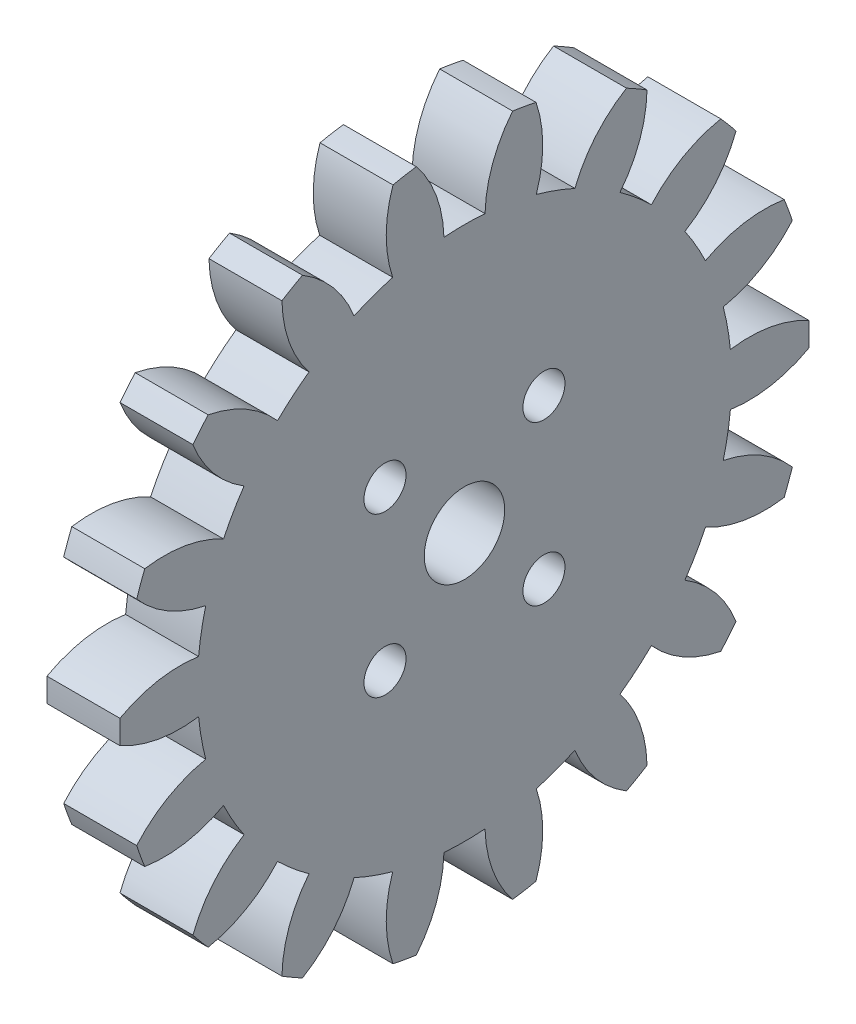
ISO-10303-21;
HEADER;
FILE_DESCRIPTION(('STEP AP214'),'2;1');
FILE_NAME('part.step','',(''),(''),'','','');
FILE_SCHEMA(('AUTOMOTIVE_DESIGN { 1 0 10303 214 1 1 1 1 }'));
ENDSEC;
DATA;
#1=APPLICATION_CONTEXT('core data for automotive mechanical design processes');
#2=APPLICATION_PROTOCOL_DEFINITION('international standard','automotive_design',2000,#1);
#3=PRODUCT_CONTEXT('',#1,'mechanical');
#4=PRODUCT('Part','Part','',(#3));
#5=PRODUCT_RELATED_PRODUCT_CATEGORY('part','',(#4));
#6=PRODUCT_DEFINITION_FORMATION('','',#4);
#7=PRODUCT_DEFINITION_CONTEXT('part definition',#1,'design');
#8=PRODUCT_DEFINITION('design','',#6,#7);
#9=PRODUCT_DEFINITION_SHAPE('','',#8);
#10=(LENGTH_UNIT() NAMED_UNIT(*) SI_UNIT(.MILLI.,.METRE.));
#11=(NAMED_UNIT(*) PLANE_ANGLE_UNIT() SI_UNIT($,.RADIAN.));
#12=(NAMED_UNIT(*) SI_UNIT($,.STERADIAN.) SOLID_ANGLE_UNIT());
#13=UNCERTAINTY_MEASURE_WITH_UNIT(LENGTH_MEASURE(1.E-05),#10,'distance_accuracy_value','');
#14=(GEOMETRIC_REPRESENTATION_CONTEXT(3) GLOBAL_UNCERTAINTY_ASSIGNED_CONTEXT((#13)) GLOBAL_UNIT_ASSIGNED_CONTEXT((#10,
#11,#12)) REPRESENTATION_CONTEXT('',''));
#15=CARTESIAN_POINT('',(0.,0.,0.));
#16=DIRECTION('',(0.,0.,1.));
#17=DIRECTION('',(1.,0.,0.));
#18=AXIS2_PLACEMENT_3D('',#15,#16,#17);
#19=CARTESIAN_POINT('',(6.35,0.,0.));
#20=DIRECTION('',(-1.,0.,0.));
#21=DIRECTION('',(0.,0.,1.));
#22=AXIS2_PLACEMENT_3D('',#19,#20,#21);
#23=PLANE('',#22);
#24=CARTESIAN_POINT('',(6.35,-6.91479721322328,-6.91479721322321));
#25=DIRECTION('',(-1.,0.,0.));
#26=DIRECTION('',(0.,0.,1.));
#27=AXIS2_PLACEMENT_3D('',#24,#25,#26);
#28=CIRCLE('',#27,1.83);
#29=CARTESIAN_POINT('',(6.35,-6.91479721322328,-5.08479721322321));
#30=VERTEX_POINT('',#29);
#31=EDGE_CURVE('E1130',#30,#30,#28,.F.);
#32=ORIENTED_EDGE('',*,*,#31,.F.);
#33=EDGE_LOOP('',(#32));
#34=FACE_BOUND('',#33,.T.);
#35=CARTESIAN_POINT('',(6.35,-6.91479721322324,6.91479721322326));
#36=DIRECTION('',(-1.,0.,0.));
#37=DIRECTION('',(0.,0.,1.));
#38=AXIS2_PLACEMENT_3D('',#35,#36,#37);
#39=CIRCLE('',#38,1.83);
#40=CARTESIAN_POINT('',(6.35,-6.91479721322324,8.74479721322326));
#41=VERTEX_POINT('',#40);
#42=EDGE_CURVE('E1134',#41,#41,#39,.F.);
#43=ORIENTED_EDGE('',*,*,#42,.F.);
#44=EDGE_LOOP('',(#43));
#45=FACE_BOUND('',#44,.T.);
#46=CARTESIAN_POINT('',(6.35,6.91479721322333,6.91479721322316));
#47=DIRECTION('',(-1.,0.,0.));
#48=DIRECTION('',(0.,0.,1.));
#49=AXIS2_PLACEMENT_3D('',#46,#47,#48);
#50=CIRCLE('',#49,1.83);
#51=CARTESIAN_POINT('',(6.35,6.91479721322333,8.74479721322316));
#52=VERTEX_POINT('',#51);
#53=EDGE_CURVE('E1138',#52,#52,#50,.F.);
#54=ORIENTED_EDGE('',*,*,#53,.F.);
#55=EDGE_LOOP('',(#54));
#56=FACE_BOUND('',#55,.T.);
#57=CARTESIAN_POINT('',(6.35,6.91479721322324,-6.91479721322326));
#58=DIRECTION('',(-1.,0.,0.));
#59=DIRECTION('',(0.,0.,1.));
#60=AXIS2_PLACEMENT_3D('',#57,#58,#59);
#61=CIRCLE('',#60,1.83);
#62=CARTESIAN_POINT('',(6.35,6.91479721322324,-5.08479721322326));
#63=VERTEX_POINT('',#62);
#64=EDGE_CURVE('E1142',#63,#63,#61,.F.);
#65=ORIENTED_EDGE('',*,*,#64,.F.);
#66=EDGE_LOOP('',(#65));
#67=FACE_BOUND('',#66,.T.);
#68=CARTESIAN_POINT('',(6.35,0.,0.));
#69=DIRECTION('',(-1.,0.,0.));
#70=DIRECTION('',(0.,0.,1.));
#71=AXIS2_PLACEMENT_3D('',#68,#69,#70);
#72=CIRCLE('',#71,3.5);
#73=CARTESIAN_POINT('',(6.35,0.,3.5));
#74=VERTEX_POINT('',#73);
#75=EDGE_CURVE('E708',#74,#74,#72,.F.);
#76=ORIENTED_EDGE('',*,*,#75,.F.);
#77=EDGE_LOOP('',(#76));
#78=FACE_BOUND('',#77,.T.);
#79=CARTESIAN_POINT('',(6.35,22.3542304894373,13.5494377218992));
#80=DIRECTION('',(-1.,0.,0.));
#81=DIRECTION('',(0.,0.86602540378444,-0.499999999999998));
#82=AXIS2_PLACEMENT_3D('',#79,#80,#81);
#83=CIRCLE('',#82,10.8);
#84=CARTESIAN_POINT('',(6.35,13.1384921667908,19.180615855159));
#85=VERTEX_POINT('',#84);
#86=CARTESIAN_POINT('',(6.35,18.4815086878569,23.6312047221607));
#87=VERTEX_POINT('',#86);
#88=EDGE_CURVE('E494',#85,#87,#83,.T.);
#89=ORIENTED_EDGE('',*,*,#88,.F.);
#90=CARTESIAN_POINT('',(6.35,0.,0.));
#91=DIRECTION('',(-1.,0.,0.));
#92=DIRECTION('',(0.,0.86602540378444,-0.499999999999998));
#93=AXIS2_PLACEMENT_3D('',#90,#91,#92);
#94=CIRCLE('',#93,23.249);
#95=CARTESIAN_POINT('',(6.35,10.0416545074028,20.9685759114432));
#96=VERTEX_POINT('',#95);
#97=EDGE_CURVE('E493',#96,#85,#94,.T.);
#98=ORIENTED_EDGE('',*,*,#97,.F.);
#99=CARTESIAN_POINT('',(6.35,0.55704202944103,26.134050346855));
#100=DIRECTION('',(-1.,0.,0.));
#101=DIRECTION('',(0.,0.86602540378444,-0.499999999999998));
#102=AXIS2_PLACEMENT_3D('',#99,#100,#101);
#103=CIRCLE('',#102,10.8);
#104=CARTESIAN_POINT('',(6.35,11.2244692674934,27.8210583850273));
#105=VERTEX_POINT('',#104);
#106=EDGE_CURVE('E482',#105,#96,#103,.T.);
#107=ORIENTED_EDGE('',*,*,#106,.F.);
#108=CARTESIAN_POINT('',(6.35,0.,0.));
#109=DIRECTION('',(-1.,0.,0.));
#110=DIRECTION('',(0.,0.,1.));
#111=AXIS2_PLACEMENT_3D('',#108,#109,#110);
#112=CIRCLE('',#111,30.);
#113=CARTESIAN_POINT('',(6.35,9.28458930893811,28.527116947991));
#114=VERTEX_POINT('',#113);
#115=EDGE_CURVE('E1015',#114,#105,#112,.T.);
#116=ORIENTED_EDGE('',*,*,#115,.F.);
#117=CARTESIAN_POINT('',(6.35,16.3719248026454,20.3779037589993));
#118=DIRECTION('',(-1.,0.,0.));
#119=DIRECTION('',(0.,0.984807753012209,-0.173648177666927));
#120=AXIS2_PLACEMENT_3D('',#117,#118,#119);
#121=CIRCLE('',#120,10.8);
#122=CARTESIAN_POINT('',(6.35,5.78598715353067,22.5175121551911));
#123=VERTEX_POINT('',#122);
#124=EDGE_CURVE('E527',#123,#114,#121,.T.);
#125=ORIENTED_EDGE('',*,*,#124,.F.);
#126=CARTESIAN_POINT('',(6.35,0.,0.));
#127=DIRECTION('',(-1.,0.,0.));
#128=DIRECTION('',(0.,0.984807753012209,-0.173648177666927));
#129=AXIS2_PLACEMENT_3D('',#126,#127,#128);
#130=CIRCLE('',#129,23.249);
#131=CARTESIAN_POINT('',(6.35,2.26439330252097,23.1384641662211));
#132=VERTEX_POINT('',#131);
#133=EDGE_CURVE('E532',#132,#123,#130,.T.);
#134=ORIENTED_EDGE('',*,*,#133,.F.);
#135=CARTESIAN_POINT('',(6.35,-8.41492336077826,24.7484938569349));
#136=DIRECTION('',(-1.,0.,0.));
#137=DIRECTION('',(0.,0.984807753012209,-0.173648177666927));
#138=AXIS2_PLACEMENT_3D('',#135,#136,#137);
#139=CIRCLE('',#138,10.8);
#140=CARTESIAN_POINT('',(6.35,1.03218856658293,29.9822378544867));
#141=VERTEX_POINT('',#140);
#142=EDGE_CURVE('E529',#141,#132,#139,.T.);
#143=ORIENTED_EDGE('',*,*,#142,.F.);
#144=CARTESIAN_POINT('',(6.35,-1.03218856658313,29.9822378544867));
#145=VERTEX_POINT('',#144);
#146=EDGE_CURVE('E997',#145,#141,#112,.T.);
#147=ORIENTED_EDGE('',*,*,#146,.F.);
#148=CARTESIAN_POINT('',(6.35,8.41492336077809,24.7484938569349));
#149=DIRECTION('',(-1.,0.,0.));
#150=DIRECTION('',(0.,0.984807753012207,0.173648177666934));
#151=AXIS2_PLACEMENT_3D('',#148,#149,#150);
#152=CIRCLE('',#151,10.8);
#153=CARTESIAN_POINT('',(6.35,-2.26439330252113,23.1384641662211));
#154=VERTEX_POINT('',#153);
#155=EDGE_CURVE('E544',#154,#145,#152,.T.);
#156=ORIENTED_EDGE('',*,*,#155,.F.);
#157=CARTESIAN_POINT('',(6.35,0.,0.));
#158=DIRECTION('',(-1.,0.,0.));
#159=DIRECTION('',(0.,0.984807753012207,0.173648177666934));
#160=AXIS2_PLACEMENT_3D('',#157,#158,#159);
#161=CIRCLE('',#160,23.249);
#162=CARTESIAN_POINT('',(6.35,-5.78598715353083,22.5175121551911));
#163=VERTEX_POINT('',#162);
#164=EDGE_CURVE('E549',#163,#154,#161,.T.);
#165=ORIENTED_EDGE('',*,*,#164,.F.);
#166=CARTESIAN_POINT('',(6.35,-16.3719248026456,20.3779037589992));
#167=DIRECTION('',(-1.,0.,0.));
#168=DIRECTION('',(0.,0.984807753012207,0.173648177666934));
#169=AXIS2_PLACEMENT_3D('',#166,#167,#168);
#170=CIRCLE('',#169,10.8);
#171=CARTESIAN_POINT('',(6.35,-9.2845893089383,28.5271169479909));
#172=VERTEX_POINT('',#171);
#173=EDGE_CURVE('E546',#172,#163,#170,.T.);
#174=ORIENTED_EDGE('',*,*,#173,.F.);
#175=CARTESIAN_POINT('',(6.35,-11.2244692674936,27.8210583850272));
#176=VERTEX_POINT('',#175);
#177=EDGE_CURVE('E1016',#176,#172,#112,.T.);
#178=ORIENTED_EDGE('',*,*,#177,.F.);
#179=CARTESIAN_POINT('',(6.35,-0.557042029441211,26.134050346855));
#180=DIRECTION('',(-1.,0.,0.));
#181=DIRECTION('',(0.,0.866025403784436,0.500000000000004));
#182=AXIS2_PLACEMENT_3D('',#179,#180,#181);
#183=CIRCLE('',#182,10.8);
#184=CARTESIAN_POINT('',(6.35,-10.041654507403,20.9685759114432));
#185=VERTEX_POINT('',#184);
#186=EDGE_CURVE('E614',#185,#176,#183,.T.);
#187=ORIENTED_EDGE('',*,*,#186,.F.);
#188=CARTESIAN_POINT('',(6.35,0.,0.));
#189=DIRECTION('',(-1.,0.,0.));
#190=DIRECTION('',(0.,0.866025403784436,0.500000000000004));
#191=AXIS2_PLACEMENT_3D('',#188,#189,#190);
#192=CIRCLE('',#191,23.249);
#193=CARTESIAN_POINT('',(6.35,-13.1384921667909,19.1806158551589));
#194=VERTEX_POINT('',#193);
#195=EDGE_CURVE('E619',#194,#185,#192,.T.);
#196=ORIENTED_EDGE('',*,*,#195,.F.);
#197=CARTESIAN_POINT('',(6.35,-22.3542304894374,13.549437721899));
#198=DIRECTION('',(-1.,0.,0.));
#199=DIRECTION('',(0.,0.866025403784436,0.500000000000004));
#200=AXIS2_PLACEMENT_3D('',#197,#198,#199);
#201=CIRCLE('',#200,10.8);
#202=CARTESIAN_POINT('',(6.35,-18.481508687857,23.6312047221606));
#203=VERTEX_POINT('',#202);
#204=EDGE_CURVE('E616',#203,#194,#201,.T.);
#205=ORIENTED_EDGE('',*,*,#204,.F.);
#206=CARTESIAN_POINT('',(6.35,-20.0629133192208,22.3042486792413));
#207=VERTEX_POINT('',#206);
#208=EDGE_CURVE('E1080',#207,#203,#112,.T.);
#209=ORIENTED_EDGE('',*,*,#208,.F.);
#210=CARTESIAN_POINT('',(6.35,-9.4618199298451,24.3674546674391));
#211=DIRECTION('',(-1.,0.,0.));
#212=DIRECTION('',(0.,0.642787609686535,0.766044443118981));
#213=AXIS2_PLACEMENT_3D('',#210,#211,#212);
#214=CIRCLE('',#213,10.8);
#215=CARTESIAN_POINT('',(6.35,-16.6077439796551,16.2695679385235));
#216=VERTEX_POINT('',#215);
#217=EDGE_CURVE('E597',#216,#207,#214,.T.);
#218=ORIENTED_EDGE('',*,*,#217,.F.);
#219=CARTESIAN_POINT('',(6.35,0.,0.));
#220=DIRECTION('',(-1.,0.,0.));
#221=DIRECTION('',(0.,0.642787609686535,0.766044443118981));
#222=AXIS2_PLACEMENT_3D('',#219,#220,#221);
#223=CIRCLE('',#222,23.249);
#224=CARTESIAN_POINT('',(6.35,-18.906301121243,13.530254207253));
#225=VERTEX_POINT('',#224);
#226=EDGE_CURVE('E602',#225,#216,#223,.T.);
#227=ORIENTED_EDGE('',*,*,#226,.F.);
#228=CARTESIAN_POINT('',(6.35,-25.6402860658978,5.08670952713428));
#229=DIRECTION('',(-1.,0.,0.));
#230=DIRECTION('',(0.,0.642787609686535,0.766044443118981));
#231=AXIS2_PLACEMENT_3D('',#228,#229,#230);
#232=CIRCLE('',#231,10.8);
#233=CARTESIAN_POINT('',(6.35,-25.4492853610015,15.8850204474));
#234=VERTEX_POINT('',#233);
#235=EDGE_CURVE('E599',#234,#225,#232,.T.);
#236=ORIENTED_EDGE('',*,*,#235,.F.);
#237=CARTESIAN_POINT('',(6.35,-26.4814739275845,14.0972174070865));
#238=VERTEX_POINT('',#237);
#239=EDGE_CURVE('E1074',#238,#234,#112,.T.);
#240=ORIENTED_EDGE('',*,*,#239,.F.);
#241=CARTESIAN_POINT('',(6.35,-17.2253627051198,19.6617843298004));
#242=DIRECTION('',(-1.,0.,0.));
#243=DIRECTION('',(0.,0.342020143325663,0.939692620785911));
#244=AXIS2_PLACEMENT_3D('',#241,#242,#243);
#245=CIRCLE('',#244,10.8);
#246=CARTESIAN_POINT('',(6.35,-21.170694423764,9.60820995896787));
#247=VERTEX_POINT('',#246);
#248=EDGE_CURVE('E561',#247,#238,#245,.T.);
#249=ORIENTED_EDGE('',*,*,#248,.F.);
#250=CARTESIAN_POINT('',(6.35,0.,0.));
#251=DIRECTION('',(-1.,0.,0.));
#252=DIRECTION('',(0.,0.342020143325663,0.939692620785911));
#253=AXIS2_PLACEMENT_3D('',#250,#251,#252);
#254=CIRCLE('',#253,23.249);
#255=CARTESIAN_POINT('',(6.35,-22.3937311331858,6.24794421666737));
#256=VERTEX_POINT('',#255);
#257=EDGE_CURVE('E566',#256,#247,#254,.T.);
#258=ORIENTED_EDGE('',*,*,#257,.F.);
#259=CARTESIAN_POINT('',(6.35,-25.8337447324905,-3.98955090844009));
#260=DIRECTION('',(-1.,0.,0.));
#261=DIRECTION('',(0.,0.342020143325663,0.939692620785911));
#262=AXIS2_PLACEMENT_3D('',#259,#260,#261);
#263=CIRCLE('',#262,10.8);
#264=CARTESIAN_POINT('',(6.35,-29.3475026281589,6.22286826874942));
#265=VERTEX_POINT('',#264);
#266=EDGE_CURVE('E563',#265,#256,#263,.T.);
#267=ORIENTED_EDGE('',*,*,#266,.F.);
#268=CARTESIAN_POINT('',(6.35,-29.7059779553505,4.18985366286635));
#269=VERTEX_POINT('',#268);
#270=EDGE_CURVE('E1068',#269,#265,#112,.T.);
#271=ORIENTED_EDGE('',*,*,#270,.F.);
#272=CARTESIAN_POINT('',(6.35,-22.9112725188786,12.5846126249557));
#273=DIRECTION('',(-1.,0.,0.));
#274=DIRECTION('',(0.,0.,1.));
#275=AXIS2_PLACEMENT_3D('',#272,#273,#274);
#276=CIRCLE('',#275,10.8);
#277=CARTESIAN_POINT('',(6.35,-23.1801466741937,1.78796005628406));
#278=VERTEX_POINT('',#277);
#279=EDGE_CURVE('E580',#278,#269,#276,.T.);
#280=ORIENTED_EDGE('',*,*,#279,.F.);
#281=CARTESIAN_POINT('',(6.35,0.,0.));
#282=DIRECTION('',(-1.,0.,0.));
#283=DIRECTION('',(0.,0.,1.));
#284=AXIS2_PLACEMENT_3D('',#281,#282,#283);
#285=CIRCLE('',#284,23.249);
#286=CARTESIAN_POINT('',(6.35,-23.1801466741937,-1.78796005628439));
#287=VERTEX_POINT('',#286);
#288=EDGE_CURVE('E585',#287,#278,#285,.T.);
#289=ORIENTED_EDGE('',*,*,#288,.F.);
#290=CARTESIAN_POINT('',(6.35,-22.9112725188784,-12.584612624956));
#291=DIRECTION('',(-1.,0.,0.));
#292=DIRECTION('',(0.,0.,1.));
#293=AXIS2_PLACEMENT_3D('',#290,#291,#292);
#294=CIRCLE('',#293,10.8);
#295=CARTESIAN_POINT('',(6.35,-29.7059779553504,-4.18985366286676));
#296=VERTEX_POINT('',#295);
#297=EDGE_CURVE('E582',#296,#287,#294,.T.);
#298=ORIENTED_EDGE('',*,*,#297,.F.);
#299=CARTESIAN_POINT('',(6.35,-29.3475026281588,-6.22286826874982));
#300=VERTEX_POINT('',#299);
#301=EDGE_CURVE('E1062',#300,#296,#112,.T.);
#302=ORIENTED_EDGE('',*,*,#301,.F.);
#303=CARTESIAN_POINT('',(6.35,-25.8337447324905,3.98955090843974));
#304=DIRECTION('',(-1.,0.,0.));
#305=DIRECTION('',(0.,-0.342020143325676,0.939692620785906));
#306=AXIS2_PLACEMENT_3D('',#303,#304,#305);
#307=CIRCLE('',#306,10.8);
#308=CARTESIAN_POINT('',(6.35,-22.3937311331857,-6.24794421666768));
#309=VERTEX_POINT('',#308);
#310=EDGE_CURVE('E682',#309,#300,#307,.T.);
#311=ORIENTED_EDGE('',*,*,#310,.F.);
#312=CARTESIAN_POINT('',(6.35,0.,0.));
#313=DIRECTION('',(-1.,0.,0.));
#314=DIRECTION('',(0.,-0.342020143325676,0.939692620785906));
#315=AXIS2_PLACEMENT_3D('',#312,#313,#314);
#316=CIRCLE('',#315,23.249);
#317=CARTESIAN_POINT('',(6.35,-21.1706944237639,-9.60820995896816));
#318=VERTEX_POINT('',#317);
#319=EDGE_CURVE('E687',#318,#309,#316,.T.);
#320=ORIENTED_EDGE('',*,*,#319,.F.);
#321=CARTESIAN_POINT('',(6.35,-17.2253627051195,-19.6617843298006));
#322=DIRECTION('',(-1.,0.,0.));
#323=DIRECTION('',(0.,-0.342020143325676,0.939692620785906));
#324=AXIS2_PLACEMENT_3D('',#321,#322,#323);
#325=CIRCLE('',#324,10.8);
#326=CARTESIAN_POINT('',(6.35,-26.4814739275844,-14.0972174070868));
#327=VERTEX_POINT('',#326);
#328=EDGE_CURVE('E684',#327,#318,#325,.T.);
#329=ORIENTED_EDGE('',*,*,#328,.F.);
#330=CARTESIAN_POINT('',(6.35,-25.4492853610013,-15.8850204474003));
#331=VERTEX_POINT('',#330);
#332=EDGE_CURVE('E1056',#331,#327,#112,.T.);
#333=ORIENTED_EDGE('',*,*,#332,.F.);
#334=CARTESIAN_POINT('',(6.35,-25.6402860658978,-5.08670952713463));
#335=DIRECTION('',(-1.,0.,0.));
#336=DIRECTION('',(0.,-0.642787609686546,0.766044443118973));
#337=AXIS2_PLACEMENT_3D('',#334,#335,#336);
#338=CIRCLE('',#337,10.8);
#339=CARTESIAN_POINT('',(6.35,-18.9063011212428,-13.5302542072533));
#340=VERTEX_POINT('',#339);
#341=EDGE_CURVE('E665',#340,#331,#338,.T.);
#342=ORIENTED_EDGE('',*,*,#341,.F.);
#343=CARTESIAN_POINT('',(6.35,0.,0.));
#344=DIRECTION('',(-1.,0.,0.));
#345=DIRECTION('',(0.,-0.642787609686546,0.766044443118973));
#346=AXIS2_PLACEMENT_3D('',#343,#344,#345);
#347=CIRCLE('',#346,23.249);
#348=CARTESIAN_POINT('',(6.35,-16.6077439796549,-16.2695679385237));
#349=VERTEX_POINT('',#348);
#350=EDGE_CURVE('E670',#349,#340,#347,.T.);
#351=ORIENTED_EDGE('',*,*,#350,.F.);
#352=CARTESIAN_POINT('',(6.35,-9.46181992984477,-24.3674546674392));
#353=DIRECTION('',(-1.,0.,0.));
#354=DIRECTION('',(0.,-0.642787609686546,0.766044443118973));
#355=AXIS2_PLACEMENT_3D('',#352,#353,#354);
#356=CIRCLE('',#355,10.8);
#357=CARTESIAN_POINT('',(6.35,-20.0629133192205,-22.3042486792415));
#358=VERTEX_POINT('',#357);
#359=EDGE_CURVE('E667',#358,#349,#356,.T.);
#360=ORIENTED_EDGE('',*,*,#359,.F.);
#361=CARTESIAN_POINT('',(6.35,-18.4815086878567,-23.6312047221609));
#362=VERTEX_POINT('',#361);
#363=EDGE_CURVE('E1050',#362,#358,#112,.T.);
#364=ORIENTED_EDGE('',*,*,#363,.F.);
#365=CARTESIAN_POINT('',(6.35,-22.3542304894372,-13.5494377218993));
#366=DIRECTION('',(-1.,0.,0.));
#367=DIRECTION('',(0.,-0.866025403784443,0.499999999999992));
#368=AXIS2_PLACEMENT_3D('',#365,#366,#367);
#369=CIRCLE('',#368,10.8);
#370=CARTESIAN_POINT('',(6.35,-13.1384921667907,-19.1806158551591));
#371=VERTEX_POINT('',#370);
#372=EDGE_CURVE('E629',#371,#362,#369,.T.);
#373=ORIENTED_EDGE('',*,*,#372,.F.);
#374=CARTESIAN_POINT('',(6.35,0.,0.));
#375=DIRECTION('',(-1.,0.,0.));
#376=DIRECTION('',(0.,-0.866025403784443,0.499999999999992));
#377=AXIS2_PLACEMENT_3D('',#374,#375,#376);
#378=CIRCLE('',#377,23.249);
#379=CARTESIAN_POINT('',(6.35,-10.0416545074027,-20.9685759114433));
#380=VERTEX_POINT('',#379);
#381=EDGE_CURVE('E634',#380,#371,#378,.T.);
#382=ORIENTED_EDGE('',*,*,#381,.F.);
#383=CARTESIAN_POINT('',(6.35,-0.557042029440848,-26.134050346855));
#384=DIRECTION('',(-1.,0.,0.));
#385=DIRECTION('',(0.,-0.866025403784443,0.499999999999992));
#386=AXIS2_PLACEMENT_3D('',#383,#384,#385);
#387=CIRCLE('',#386,10.8);
#388=CARTESIAN_POINT('',(6.35,-11.2244692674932,-27.8210583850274));
#389=VERTEX_POINT('',#388);
#390=EDGE_CURVE('E631',#389,#380,#387,.T.);
#391=ORIENTED_EDGE('',*,*,#390,.F.);
#392=CARTESIAN_POINT('',(6.35,-9.28458930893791,-28.527116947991));
#393=VERTEX_POINT('',#392);
#394=EDGE_CURVE('E1044',#393,#389,#112,.T.);
#395=ORIENTED_EDGE('',*,*,#394,.F.);
#396=CARTESIAN_POINT('',(6.35,-16.3719248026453,-20.3779037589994));
#397=DIRECTION('',(-1.,0.,0.));
#398=DIRECTION('',(0.,-0.98480775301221,0.173648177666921));
#399=AXIS2_PLACEMENT_3D('',#396,#397,#398);
#400=CIRCLE('',#399,10.8);
#401=CARTESIAN_POINT('',(6.35,-5.78598715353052,-22.5175121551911));
#402=VERTEX_POINT('',#401);
#403=EDGE_CURVE('E648',#402,#393,#400,.T.);
#404=ORIENTED_EDGE('',*,*,#403,.F.);
#405=CARTESIAN_POINT('',(6.35,0.,0.));
#406=DIRECTION('',(-1.,0.,0.));
#407=DIRECTION('',(0.,-0.98480775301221,0.173648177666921));
#408=AXIS2_PLACEMENT_3D('',#405,#406,#407);
#409=CIRCLE('',#408,23.249);
#410=CARTESIAN_POINT('',(6.35,-2.26439330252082,-23.1384641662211));
#411=VERTEX_POINT('',#410);
#412=EDGE_CURVE('E653',#411,#402,#409,.T.);
#413=ORIENTED_EDGE('',*,*,#412,.F.);
#414=CARTESIAN_POINT('',(6.35,8.41492336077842,-24.7484938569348));
#415=DIRECTION('',(-1.,0.,0.));
#416=DIRECTION('',(0.,-0.98480775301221,0.173648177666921));
#417=AXIS2_PLACEMENT_3D('',#414,#415,#416);
#418=CIRCLE('',#417,10.8);
#419=CARTESIAN_POINT('',(6.35,-1.03218856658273,-29.9822378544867));
#420=VERTEX_POINT('',#419);
#421=EDGE_CURVE('E650',#420,#411,#418,.T.);
#422=ORIENTED_EDGE('',*,*,#421,.F.);
#423=CARTESIAN_POINT('',(6.35,1.03218856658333,-29.9822378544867));
#424=VERTEX_POINT('',#423);
#425=EDGE_CURVE('E1038',#424,#420,#112,.T.);
#426=ORIENTED_EDGE('',*,*,#425,.F.);
#427=CARTESIAN_POINT('',(6.35,-8.41492336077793,-24.748493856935));
#428=DIRECTION('',(-1.,0.,0.));
#429=DIRECTION('',(0.,-0.984807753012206,-0.17364817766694));
#430=AXIS2_PLACEMENT_3D('',#427,#428,#429);
#431=CIRCLE('',#430,10.8);
#432=CARTESIAN_POINT('',(6.35,2.26439330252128,-23.1384641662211));
#433=VERTEX_POINT('',#432);
#434=EDGE_CURVE('E733',#433,#424,#431,.T.);
#435=ORIENTED_EDGE('',*,*,#434,.F.);
#436=CARTESIAN_POINT('',(6.35,0.,0.));
#437=DIRECTION('',(-1.,0.,0.));
#438=DIRECTION('',(0.,-0.984807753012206,-0.17364817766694));
#439=AXIS2_PLACEMENT_3D('',#436,#437,#438);
#440=CIRCLE('',#439,23.249);
#441=CARTESIAN_POINT('',(6.35,5.78598715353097,-22.517512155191));
#442=VERTEX_POINT('',#441);
#443=EDGE_CURVE('E738',#442,#433,#440,.T.);
#444=ORIENTED_EDGE('',*,*,#443,.F.);
#445=CARTESIAN_POINT('',(6.35,16.3719248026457,-20.3779037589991));
#446=DIRECTION('',(-1.,0.,0.));
#447=DIRECTION('',(0.,-0.984807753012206,-0.17364817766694));
#448=AXIS2_PLACEMENT_3D('',#445,#446,#447);
#449=CIRCLE('',#448,10.8);
#450=CARTESIAN_POINT('',(6.35,9.28458930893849,-28.5271169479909));
#451=VERTEX_POINT('',#450);
#452=EDGE_CURVE('E735',#451,#442,#449,.T.);
#453=ORIENTED_EDGE('',*,*,#452,.F.);
#454=CARTESIAN_POINT('',(6.35,11.2244692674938,-27.8210583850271));
#455=VERTEX_POINT('',#454);
#456=EDGE_CURVE('E1032',#455,#451,#112,.T.);
#457=ORIENTED_EDGE('',*,*,#456,.F.);
#458=CARTESIAN_POINT('',(6.35,0.557042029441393,-26.134050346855));
#459=DIRECTION('',(-1.,0.,0.));
#460=DIRECTION('',(0.,-0.866025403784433,-0.50000000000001));
#461=AXIS2_PLACEMENT_3D('',#458,#459,#460);
#462=CIRCLE('',#461,10.8);
#463=CARTESIAN_POINT('',(6.35,10.0416545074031,-20.9685759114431));
#464=VERTEX_POINT('',#463);
#465=EDGE_CURVE('E750',#464,#455,#462,.T.);
#466=ORIENTED_EDGE('',*,*,#465,.F.);
#467=CARTESIAN_POINT('',(6.35,0.,0.));
#468=DIRECTION('',(-1.,0.,0.));
#469=DIRECTION('',(0.,-0.866025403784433,-0.50000000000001));
#470=AXIS2_PLACEMENT_3D('',#467,#468,#469);
#471=CIRCLE('',#470,23.249);
#472=CARTESIAN_POINT('',(6.35,13.1384921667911,-19.1806158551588));
#473=VERTEX_POINT('',#472);
#474=EDGE_CURVE('E755',#473,#464,#471,.T.);
#475=ORIENTED_EDGE('',*,*,#474,.F.);
#476=CARTESIAN_POINT('',(6.35,22.3542304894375,-13.5494377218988));
#477=DIRECTION('',(-1.,0.,0.));
#478=DIRECTION('',(0.,-0.866025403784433,-0.50000000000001));
#479=AXIS2_PLACEMENT_3D('',#476,#477,#478);
#480=CIRCLE('',#479,10.8);
#481=CARTESIAN_POINT('',(6.35,18.4815086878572,-23.6312047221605));
#482=VERTEX_POINT('',#481);
#483=EDGE_CURVE('E752',#482,#473,#480,.T.);
#484=ORIENTED_EDGE('',*,*,#483,.F.);
#485=CARTESIAN_POINT('',(6.35,20.0629133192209,-22.3042486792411));
#486=VERTEX_POINT('',#485);
#487=EDGE_CURVE('E1026',#486,#482,#112,.T.);
#488=ORIENTED_EDGE('',*,*,#487,.F.);
#489=CARTESIAN_POINT('',(6.35,9.46181992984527,-24.367454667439));
#490=DIRECTION('',(-1.,0.,0.));
#491=DIRECTION('',(0.,-0.64278760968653,-0.766044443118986));
#492=AXIS2_PLACEMENT_3D('',#489,#490,#491);
#493=CIRCLE('',#492,10.8);
#494=CARTESIAN_POINT('',(6.35,16.6077439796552,-16.2695679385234));
#495=VERTEX_POINT('',#494);
#496=EDGE_CURVE('E716',#495,#486,#493,.T.);
#497=ORIENTED_EDGE('',*,*,#496,.F.);
#498=CARTESIAN_POINT('',(6.35,0.,0.));
#499=DIRECTION('',(-1.,0.,0.));
#500=DIRECTION('',(0.,-0.64278760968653,-0.766044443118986));
#501=AXIS2_PLACEMENT_3D('',#498,#499,#500);
#502=CIRCLE('',#501,23.249);
#503=CARTESIAN_POINT('',(6.35,18.9063011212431,-13.5302542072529));
#504=VERTEX_POINT('',#503);
#505=EDGE_CURVE('E721',#504,#495,#502,.T.);
#506=ORIENTED_EDGE('',*,*,#505,.F.);
#507=CARTESIAN_POINT('',(6.35,25.6402860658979,-5.0867095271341));
#508=DIRECTION('',(-1.,0.,0.));
#509=DIRECTION('',(0.,-0.64278760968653,-0.766044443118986));
#510=AXIS2_PLACEMENT_3D('',#507,#508,#509);
#511=CIRCLE('',#510,10.8);
#512=CARTESIAN_POINT('',(6.35,25.4492853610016,-15.8850204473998));
#513=VERTEX_POINT('',#512);
#514=EDGE_CURVE('E718',#513,#504,#511,.T.);
#515=ORIENTED_EDGE('',*,*,#514,.F.);
#516=CARTESIAN_POINT('',(6.35,26.4814739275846,-14.0972174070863));
#517=VERTEX_POINT('',#516);
#518=EDGE_CURVE('E882',#517,#513,#112,.T.);
#519=ORIENTED_EDGE('',*,*,#518,.F.);
#520=CARTESIAN_POINT('',(6.35,17.2253627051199,-19.6617843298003));
#521=DIRECTION('',(-1.,0.,0.));
#522=DIRECTION('',(0.,-0.342020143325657,-0.939692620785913));
#523=AXIS2_PLACEMENT_3D('',#520,#521,#522);
#524=CIRCLE('',#523,10.8);
#525=CARTESIAN_POINT('',(6.35,21.1706944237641,-9.60820995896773));
#526=VERTEX_POINT('',#525);
#527=EDGE_CURVE('E697',#526,#517,#524,.T.);
#528=ORIENTED_EDGE('',*,*,#527,.F.);
#529=CARTESIAN_POINT('',(6.35,0.,0.));
#530=DIRECTION('',(-1.,0.,0.));
#531=DIRECTION('',(0.,-0.342020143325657,-0.939692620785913));
#532=AXIS2_PLACEMENT_3D('',#529,#530,#531);
#533=CIRCLE('',#532,23.249);
#534=CARTESIAN_POINT('',(6.35,22.3937311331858,-6.24794421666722));
#535=VERTEX_POINT('',#534);
#536=EDGE_CURVE('E702',#535,#526,#533,.T.);
#537=ORIENTED_EDGE('',*,*,#536,.F.);
#538=CARTESIAN_POINT('',(6.35,25.8337447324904,3.98955090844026));
#539=DIRECTION('',(-1.,0.,0.));
#540=DIRECTION('',(0.,-0.342020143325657,-0.939692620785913));
#541=AXIS2_PLACEMENT_3D('',#538,#539,#540);
#542=CIRCLE('',#541,10.8);
#543=CARTESIAN_POINT('',(6.35,29.3475026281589,-6.22286826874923));
#544=VERTEX_POINT('',#543);
#545=EDGE_CURVE('E699',#544,#535,#542,.T.);
#546=ORIENTED_EDGE('',*,*,#545,.F.);
#547=CARTESIAN_POINT('',(6.35,29.7059779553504,-4.18985366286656));
#548=VERTEX_POINT('',#547);
#549=EDGE_CURVE('E878',#548,#544,#112,.T.);
#550=ORIENTED_EDGE('',*,*,#549,.F.);
#551=CARTESIAN_POINT('',(6.35,22.9112725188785,-12.5846126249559));
#552=DIRECTION('',(-1.,0.,0.));
#553=DIRECTION('',(0.,0.,-1.));
#554=AXIS2_PLACEMENT_3D('',#551,#552,#553);
#555=CIRCLE('',#554,10.8);
#556=CARTESIAN_POINT('',(6.35,23.1801466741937,-1.78796005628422));
#557=VERTEX_POINT('',#556);
#558=EDGE_CURVE('E850',#557,#548,#555,.T.);
#559=ORIENTED_EDGE('',*,*,#558,.F.);
#560=CARTESIAN_POINT('',(6.35,0.,0.));
#561=DIRECTION('',(-1.,0.,0.));
#562=DIRECTION('',(0.,0.,-1.));
#563=AXIS2_PLACEMENT_3D('',#560,#561,#562);
#564=CIRCLE('',#563,23.249);
#565=CARTESIAN_POINT('',(6.35,23.1801466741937,1.78796005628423));
#566=VERTEX_POINT('',#565);
#567=EDGE_CURVE('E855',#566,#557,#564,.T.);
#568=ORIENTED_EDGE('',*,*,#567,.F.);
#569=CARTESIAN_POINT('',(6.35,22.9112725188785,12.5846126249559));
#570=DIRECTION('',(-1.,0.,0.));
#571=DIRECTION('',(0.,0.,-1.));
#572=AXIS2_PLACEMENT_3D('',#569,#570,#571);
#573=CIRCLE('',#572,10.8);
#574=CARTESIAN_POINT('',(6.35,29.7059779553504,4.18985366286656));
#575=VERTEX_POINT('',#574);
#576=EDGE_CURVE('E852',#575,#566,#573,.T.);
#577=ORIENTED_EDGE('',*,*,#576,.F.);
#578=CARTESIAN_POINT('',(6.35,29.3475026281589,6.22286826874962));
#579=VERTEX_POINT('',#578);
#580=EDGE_CURVE('E875',#579,#575,#112,.T.);
#581=ORIENTED_EDGE('',*,*,#580,.F.);
#582=CARTESIAN_POINT('',(6.35,25.8337447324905,-3.98955090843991));
#583=DIRECTION('',(-1.,0.,0.));
#584=DIRECTION('',(0.,0.342020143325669,-0.939692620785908));
#585=AXIS2_PLACEMENT_3D('',#582,#583,#584);
#586=CIRCLE('',#585,10.8);
#587=CARTESIAN_POINT('',(6.35,22.3937311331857,6.24794421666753));
#588=VERTEX_POINT('',#587);
#589=EDGE_CURVE('E828',#588,#579,#586,.T.);
#590=ORIENTED_EDGE('',*,*,#589,.F.);
#591=CARTESIAN_POINT('',(6.35,0.,0.));
#592=DIRECTION('',(-1.,0.,0.));
#593=DIRECTION('',(0.,0.342020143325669,-0.939692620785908));
#594=AXIS2_PLACEMENT_3D('',#591,#592,#593);
#595=CIRCLE('',#594,23.249);
#596=CARTESIAN_POINT('',(6.35,21.1706944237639,9.60820995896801));
#597=VERTEX_POINT('',#596);
#598=EDGE_CURVE('E833',#597,#588,#595,.T.);
#599=ORIENTED_EDGE('',*,*,#598,.F.);
#600=CARTESIAN_POINT('',(6.35,17.2253627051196,19.6617843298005));
#601=DIRECTION('',(-1.,0.,0.));
#602=DIRECTION('',(0.,0.342020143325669,-0.939692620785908));
#603=AXIS2_PLACEMENT_3D('',#600,#601,#602);
#604=CIRCLE('',#603,10.8);
#605=CARTESIAN_POINT('',(6.35,26.4814739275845,14.0972174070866));
#606=VERTEX_POINT('',#605);
#607=EDGE_CURVE('E830',#606,#597,#604,.T.);
#608=ORIENTED_EDGE('',*,*,#607,.F.);
#609=CARTESIAN_POINT('',(6.35,25.4492853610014,15.8850204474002));
#610=VERTEX_POINT('',#609);
#611=EDGE_CURVE('E883',#610,#606,#112,.T.);
#612=ORIENTED_EDGE('',*,*,#611,.F.);
#613=CARTESIAN_POINT('',(6.35,25.6402860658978,5.08670952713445));
#614=DIRECTION('',(-1.,0.,0.));
#615=DIRECTION('',(0.,0.642787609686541,-0.766044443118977));
#616=AXIS2_PLACEMENT_3D('',#613,#614,#615);
#617=CIRCLE('',#616,10.8);
#618=CARTESIAN_POINT('',(6.35,18.9063011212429,13.5302542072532));
#619=VERTEX_POINT('',#618);
#620=EDGE_CURVE('E512',#619,#610,#617,.T.);
#621=ORIENTED_EDGE('',*,*,#620,.F.);
#622=CARTESIAN_POINT('',(6.35,0.,0.));
#623=DIRECTION('',(-1.,0.,0.));
#624=DIRECTION('',(0.,0.642787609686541,-0.766044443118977));
#625=AXIS2_PLACEMENT_3D('',#622,#623,#624);
#626=CIRCLE('',#625,23.249);
#627=CARTESIAN_POINT('',(6.35,16.607743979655,16.2695679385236));
#628=VERTEX_POINT('',#627);
#629=EDGE_CURVE('E517',#628,#619,#626,.T.);
#630=ORIENTED_EDGE('',*,*,#629,.F.);
#631=CARTESIAN_POINT('',(6.35,9.46181992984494,24.3674546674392));
#632=DIRECTION('',(-1.,0.,0.));
#633=DIRECTION('',(0.,0.642787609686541,-0.766044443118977));
#634=AXIS2_PLACEMENT_3D('',#631,#632,#633);
#635=CIRCLE('',#634,10.8);
#636=CARTESIAN_POINT('',(6.35,20.0629133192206,22.3042486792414));
#637=VERTEX_POINT('',#636);
#638=EDGE_CURVE('E514',#637,#628,#635,.T.);
#639=ORIENTED_EDGE('',*,*,#638,.F.);
#640=EDGE_CURVE('E932',#87,#637,#112,.T.);
#641=ORIENTED_EDGE('',*,*,#640,.F.);
#642=EDGE_LOOP('',(#89,#98,#107,#116,#125,#134,#143,#147,#156,#165,#174,#178,#187,#196,#205,
#209,#218,#227,#236,#240,#249,#258,#267,#271,#280,#289,#298,#302,#311,#320,#329,#333,#342,#351,
#360,#364,#373,#382,#391,#395,#404,#413,#422,#426,#435,#444,#453,#457,#466,#475,#484,#488,#497,
#506,#515,#519,#528,#537,#546,#550,#559,#568,#577,#581,#590,#599,#608,#612,#621,#630,#639,#641));
#643=FACE_BOUND('',#642,.T.);
#644=ADVANCED_FACE('F33',(#34,#45,#56,#67,#78,#643),#23,.F.);
#645=CARTESIAN_POINT('',(-10.,0.,0.));
#646=DIRECTION('',(-1.,0.,0.));
#647=DIRECTION('',(0.,0.,1.));
#648=AXIS2_PLACEMENT_3D('',#645,#646,#647);
#649=CYLINDRICAL_SURFACE('',#648,30.);
#650=DIRECTION('',(-1.,0.,0.));
#651=VECTOR('',#650,1.);
#652=CARTESIAN_POINT('',(3.175,18.4815086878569,23.6312047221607));
#653=LINE('',#652,#651);
#654=CARTESIAN_POINT('',(0.,18.4815086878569,23.6312047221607));
#655=VERTEX_POINT('',#654);
#656=EDGE_CURVE('E825',#87,#655,#653,.T.);
#657=ORIENTED_EDGE('',*,*,#656,.F.);
#658=ORIENTED_EDGE('',*,*,#640,.T.);
#659=DIRECTION('',(-1.,0.,0.));
#660=VECTOR('',#659,1.);
#661=CARTESIAN_POINT('',(3.175,20.0629133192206,22.3042486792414));
#662=LINE('',#661,#660);
#663=CARTESIAN_POINT('',(0.,20.0629133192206,22.3042486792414));
#664=VERTEX_POINT('',#663);
#665=EDGE_CURVE('E820',#664,#637,#662,.F.);
#666=ORIENTED_EDGE('',*,*,#665,.F.);
#667=CARTESIAN_POINT('',(0.,0.,0.));
#668=DIRECTION('',(-1.,0.,0.));
#669=DIRECTION('',(0.,0.,1.));
#670=AXIS2_PLACEMENT_3D('',#667,#668,#669);
#671=CIRCLE('',#670,30.);
#672=EDGE_CURVE('E931',#655,#664,#671,.T.);
#673=ORIENTED_EDGE('',*,*,#672,.F.);
#674=EDGE_LOOP('',(#657,#658,#666,#673));
#675=FACE_BOUND('',#674,.T.);
#676=ADVANCED_FACE('F930',(#675),#649,.T.);
#677=DIRECTION('',(-1.,0.,0.));
#678=VECTOR('',#677,1.);
#679=CARTESIAN_POINT('',(3.175,11.2244692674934,27.8210583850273));
#680=LINE('',#679,#678);
#681=CARTESIAN_POINT('',(0.,11.2244692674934,27.8210583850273));
#682=VERTEX_POINT('',#681);
#683=EDGE_CURVE('E488',#682,#105,#680,.F.);
#684=ORIENTED_EDGE('',*,*,#683,.F.);
#685=CARTESIAN_POINT('',(0.,9.2845893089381,28.527116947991));
#686=VERTEX_POINT('',#685);
#687=EDGE_CURVE('E934',#686,#682,#671,.T.);
#688=ORIENTED_EDGE('',*,*,#687,.F.);
#689=DIRECTION('',(-1.,0.,0.));
#690=VECTOR('',#689,1.);
#691=CARTESIAN_POINT('',(3.175,9.28458930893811,28.527116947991));
#692=LINE('',#691,#690);
#693=EDGE_CURVE('E818',#114,#686,#692,.T.);
#694=ORIENTED_EDGE('',*,*,#693,.F.);
#695=ORIENTED_EDGE('',*,*,#115,.T.);
#696=EDGE_LOOP('',(#684,#688,#694,#695));
#697=FACE_BOUND('',#696,.T.);
#698=ADVANCED_FACE('F1014',(#697),#649,.T.);
#699=DIRECTION('',(-1.,0.,0.));
#700=VECTOR('',#699,1.);
#701=CARTESIAN_POINT('',(3.175,25.4492853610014,15.8850204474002));
#702=LINE('',#701,#700);
#703=CARTESIAN_POINT('',(0.,25.4492853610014,15.8850204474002));
#704=VERTEX_POINT('',#703);
#705=EDGE_CURVE('E822',#610,#704,#702,.T.);
#706=ORIENTED_EDGE('',*,*,#705,.F.);
#707=ORIENTED_EDGE('',*,*,#611,.T.);
#708=DIRECTION('',(-1.,0.,0.));
#709=VECTOR('',#708,1.);
#710=CARTESIAN_POINT('',(3.175,26.4814739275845,14.0972174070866));
#711=LINE('',#710,#709);
#712=CARTESIAN_POINT('',(0.,26.4814739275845,14.0972174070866));
#713=VERTEX_POINT('',#712);
#714=EDGE_CURVE('E844',#713,#606,#711,.F.);
#715=ORIENTED_EDGE('',*,*,#714,.F.);
#716=EDGE_CURVE('E877',#704,#713,#671,.T.);
#717=ORIENTED_EDGE('',*,*,#716,.F.);
#718=EDGE_LOOP('',(#706,#707,#715,#717));
#719=FACE_BOUND('',#718,.T.);
#720=ADVANCED_FACE('F1155',(#719),#649,.T.);
#721=DIRECTION('',(-1.,0.,0.));
#722=VECTOR('',#721,1.);
#723=CARTESIAN_POINT('',(3.175,1.03218856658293,29.9822378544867));
#724=LINE('',#723,#722);
#725=CARTESIAN_POINT('',(0.,1.03218856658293,29.9822378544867));
#726=VERTEX_POINT('',#725);
#727=EDGE_CURVE('E816',#726,#141,#724,.F.);
#728=ORIENTED_EDGE('',*,*,#727,.F.);
#729=CARTESIAN_POINT('',(0.,-1.03218856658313,29.9822378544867));
#730=VERTEX_POINT('',#729);
#731=EDGE_CURVE('E936',#730,#726,#671,.T.);
#732=ORIENTED_EDGE('',*,*,#731,.F.);
#733=DIRECTION('',(-1.,0.,0.));
#734=VECTOR('',#733,1.);
#735=CARTESIAN_POINT('',(3.175,-1.03218856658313,29.9822378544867));
#736=LINE('',#735,#734);
#737=EDGE_CURVE('E814',#145,#730,#736,.T.);
#738=ORIENTED_EDGE('',*,*,#737,.F.);
#739=ORIENTED_EDGE('',*,*,#146,.T.);
#740=EDGE_LOOP('',(#728,#732,#738,#739));
#741=FACE_BOUND('',#740,.T.);
#742=ADVANCED_FACE('F994',(#741),#649,.T.);
#743=DIRECTION('',(-1.,0.,0.));
#744=VECTOR('',#743,1.);
#745=CARTESIAN_POINT('',(3.175,-9.28458930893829,28.5271169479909));
#746=LINE('',#745,#744);
#747=CARTESIAN_POINT('',(0.,-9.2845893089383,28.5271169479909));
#748=VERTEX_POINT('',#747);
#749=EDGE_CURVE('E812',#748,#172,#746,.F.);
#750=ORIENTED_EDGE('',*,*,#749,.F.);
#751=CARTESIAN_POINT('',(0.,-11.2244692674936,27.8210583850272));
#752=VERTEX_POINT('',#751);
#753=EDGE_CURVE('E982',#752,#748,#671,.T.);
#754=ORIENTED_EDGE('',*,*,#753,.F.);
#755=DIRECTION('',(-1.,0.,0.));
#756=VECTOR('',#755,1.);
#757=CARTESIAN_POINT('',(3.175,-11.2244692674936,27.8210583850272));
#758=LINE('',#757,#756);
#759=EDGE_CURVE('E802',#176,#752,#758,.T.);
#760=ORIENTED_EDGE('',*,*,#759,.F.);
#761=ORIENTED_EDGE('',*,*,#177,.T.);
#762=EDGE_LOOP('',(#750,#754,#760,#761));
#763=FACE_BOUND('',#762,.T.);
#764=ADVANCED_FACE('F1095',(#763),#649,.T.);
#765=DIRECTION('',(-1.,0.,0.));
#766=VECTOR('',#765,1.);
#767=CARTESIAN_POINT('',(3.175,-29.7059779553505,4.18985366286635));
#768=LINE('',#767,#766);
#769=CARTESIAN_POINT('',(0.,-29.7059779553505,4.18985366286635));
#770=VERTEX_POINT('',#769);
#771=EDGE_CURVE('E810',#269,#770,#768,.T.);
#772=ORIENTED_EDGE('',*,*,#771,.F.);
#773=ORIENTED_EDGE('',*,*,#270,.T.);
#774=DIRECTION('',(-1.,0.,0.));
#775=VECTOR('',#774,1.);
#776=CARTESIAN_POINT('',(3.175,-29.3475026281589,6.22286826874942));
#777=LINE('',#776,#775);
#778=CARTESIAN_POINT('',(0.,-29.3475026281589,6.22286826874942));
#779=VERTEX_POINT('',#778);
#780=EDGE_CURVE('E804',#779,#265,#777,.F.);
#781=ORIENTED_EDGE('',*,*,#780,.F.);
#782=EDGE_CURVE('E970',#770,#779,#671,.T.);
#783=ORIENTED_EDGE('',*,*,#782,.F.);
#784=EDGE_LOOP('',(#772,#773,#781,#783));
#785=FACE_BOUND('',#784,.T.);
#786=ADVANCED_FACE('F1300',(#785),#649,.T.);
#787=DIRECTION('',(-1.,0.,0.));
#788=VECTOR('',#787,1.);
#789=CARTESIAN_POINT('',(3.175,-29.7059779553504,-4.18985366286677));
#790=LINE('',#789,#788);
#791=CARTESIAN_POINT('',(0.,-29.7059779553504,-4.18985366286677));
#792=VERTEX_POINT('',#791);
#793=EDGE_CURVE('E808',#792,#296,#790,.F.);
#794=ORIENTED_EDGE('',*,*,#793,.F.);
#795=CARTESIAN_POINT('',(0.,-29.3475026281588,-6.22286826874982));
#796=VERTEX_POINT('',#795);
#797=EDGE_CURVE('E966',#796,#792,#671,.T.);
#798=ORIENTED_EDGE('',*,*,#797,.F.);
#799=DIRECTION('',(-1.,0.,0.));
#800=VECTOR('',#799,1.);
#801=CARTESIAN_POINT('',(3.175,-29.3475026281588,-6.22286826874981));
#802=LINE('',#801,#800);
#803=EDGE_CURVE('E786',#300,#796,#802,.T.);
#804=ORIENTED_EDGE('',*,*,#803,.F.);
#805=ORIENTED_EDGE('',*,*,#301,.T.);
#806=EDGE_LOOP('',(#794,#798,#804,#805));
#807=FACE_BOUND('',#806,.T.);
#808=ADVANCED_FACE('F1290',(#807),#649,.T.);
#809=DIRECTION('',(-1.,0.,0.));
#810=VECTOR('',#809,1.);
#811=CARTESIAN_POINT('',(3.175,-26.4814739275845,14.0972174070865));
#812=LINE('',#811,#810);
#813=CARTESIAN_POINT('',(0.,-26.4814739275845,14.0972174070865));
#814=VERTEX_POINT('',#813);
#815=EDGE_CURVE('E806',#238,#814,#812,.T.);
#816=ORIENTED_EDGE('',*,*,#815,.F.);
#817=ORIENTED_EDGE('',*,*,#239,.T.);
#818=DIRECTION('',(-1.,0.,0.));
#819=VECTOR('',#818,1.);
#820=CARTESIAN_POINT('',(3.175,-25.4492853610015,15.8850204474));
#821=LINE('',#820,#819);
#822=CARTESIAN_POINT('',(0.,-25.4492853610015,15.8850204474));
#823=VERTEX_POINT('',#822);
#824=EDGE_CURVE('E796',#823,#234,#821,.F.);
#825=ORIENTED_EDGE('',*,*,#824,.F.);
#826=EDGE_CURVE('E974',#814,#823,#671,.T.);
#827=ORIENTED_EDGE('',*,*,#826,.F.);
#828=EDGE_LOOP('',(#816,#817,#825,#827));
#829=FACE_BOUND('',#828,.T.);
#830=ADVANCED_FACE('F1313',(#829),#649,.T.);
#831=DIRECTION('',(-1.,0.,0.));
#832=VECTOR('',#831,1.);
#833=CARTESIAN_POINT('',(3.175,-18.481508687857,23.6312047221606));
#834=LINE('',#833,#832);
#835=CARTESIAN_POINT('',(0.,-18.481508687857,23.6312047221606));
#836=VERTEX_POINT('',#835);
#837=EDGE_CURVE('E800',#836,#203,#834,.F.);
#838=ORIENTED_EDGE('',*,*,#837,.F.);
#839=CARTESIAN_POINT('',(0.,-20.0629133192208,22.3042486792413));
#840=VERTEX_POINT('',#839);
#841=EDGE_CURVE('E978',#840,#836,#671,.T.);
#842=ORIENTED_EDGE('',*,*,#841,.F.);
#843=DIRECTION('',(-1.,0.,0.));
#844=VECTOR('',#843,1.);
#845=CARTESIAN_POINT('',(3.175,-20.0629133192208,22.3042486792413));
#846=LINE('',#845,#844);
#847=EDGE_CURVE('E798',#207,#840,#846,.T.);
#848=ORIENTED_EDGE('',*,*,#847,.F.);
#849=ORIENTED_EDGE('',*,*,#208,.T.);
#850=EDGE_LOOP('',(#838,#842,#848,#849));
#851=FACE_BOUND('',#850,.T.);
#852=ADVANCED_FACE('F1326',(#851),#649,.T.);
#853=DIRECTION('',(-1.,0.,0.));
#854=VECTOR('',#853,1.);
#855=CARTESIAN_POINT('',(3.175,-9.28458930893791,-28.527116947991));
#856=LINE('',#855,#854);
#857=CARTESIAN_POINT('',(0.,-9.28458930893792,-28.527116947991));
#858=VERTEX_POINT('',#857);
#859=EDGE_CURVE('E794',#393,#858,#856,.T.);
#860=ORIENTED_EDGE('',*,*,#859,.F.);
#861=ORIENTED_EDGE('',*,*,#394,.T.);
#862=DIRECTION('',(-1.,0.,0.));
#863=VECTOR('',#862,1.);
#864=CARTESIAN_POINT('',(3.175,-11.2244692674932,-27.8210583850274));
#865=LINE('',#864,#863);
#866=CARTESIAN_POINT('',(0.,-11.2244692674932,-27.8210583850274));
#867=VERTEX_POINT('',#866);
#868=EDGE_CURVE('E788',#867,#389,#865,.F.);
#869=ORIENTED_EDGE('',*,*,#868,.F.);
#870=EDGE_CURVE('E954',#858,#867,#671,.T.);
#871=ORIENTED_EDGE('',*,*,#870,.F.);
#872=EDGE_LOOP('',(#860,#861,#869,#871));
#873=FACE_BOUND('',#872,.T.);
#874=ADVANCED_FACE('F1251',(#873),#649,.T.);
#875=DIRECTION('',(-1.,0.,0.));
#876=VECTOR('',#875,1.);
#877=CARTESIAN_POINT('',(3.175,-1.03218856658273,-29.9822378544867));
#878=LINE('',#877,#876);
#879=CARTESIAN_POINT('',(0.,-1.03218856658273,-29.9822378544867));
#880=VERTEX_POINT('',#879);
#881=EDGE_CURVE('E792',#880,#420,#878,.F.);
#882=ORIENTED_EDGE('',*,*,#881,.F.);
#883=CARTESIAN_POINT('',(0.,1.03218856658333,-29.9822378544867));
#884=VERTEX_POINT('',#883);
#885=EDGE_CURVE('E950',#884,#880,#671,.T.);
#886=ORIENTED_EDGE('',*,*,#885,.F.);
#887=DIRECTION('',(-1.,0.,0.));
#888=VECTOR('',#887,1.);
#889=CARTESIAN_POINT('',(3.175,1.03218856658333,-29.9822378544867));
#890=LINE('',#889,#888);
#891=EDGE_CURVE('E766',#424,#884,#890,.T.);
#892=ORIENTED_EDGE('',*,*,#891,.F.);
#893=ORIENTED_EDGE('',*,*,#425,.T.);
#894=EDGE_LOOP('',(#882,#886,#892,#893));
#895=FACE_BOUND('',#894,.T.);
#896=ADVANCED_FACE('F1238',(#895),#649,.T.);
#897=DIRECTION('',(-1.,0.,0.));
#898=VECTOR('',#897,1.);
#899=CARTESIAN_POINT('',(3.175,-18.4815086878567,-23.6312047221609));
#900=LINE('',#899,#898);
#901=CARTESIAN_POINT('',(0.,-18.4815086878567,-23.6312047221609));
#902=VERTEX_POINT('',#901);
#903=EDGE_CURVE('E790',#362,#902,#900,.T.);
#904=ORIENTED_EDGE('',*,*,#903,.F.);
#905=ORIENTED_EDGE('',*,*,#363,.T.);
#906=DIRECTION('',(-1.,0.,0.));
#907=VECTOR('',#906,1.);
#908=CARTESIAN_POINT('',(3.175,-20.0629133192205,-22.3042486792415));
#909=LINE('',#908,#907);
#910=CARTESIAN_POINT('',(0.,-20.0629133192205,-22.3042486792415));
#911=VERTEX_POINT('',#910);
#912=EDGE_CURVE('E780',#911,#358,#909,.F.);
#913=ORIENTED_EDGE('',*,*,#912,.F.);
#914=EDGE_CURVE('E958',#902,#911,#671,.T.);
#915=ORIENTED_EDGE('',*,*,#914,.F.);
#916=EDGE_LOOP('',(#904,#905,#913,#915));
#917=FACE_BOUND('',#916,.T.);
#918=ADVANCED_FACE('F1264',(#917),#649,.T.);
#919=DIRECTION('',(-1.,0.,0.));
#920=VECTOR('',#919,1.);
#921=CARTESIAN_POINT('',(3.175,-26.4814739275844,-14.0972174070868));
#922=LINE('',#921,#920);
#923=CARTESIAN_POINT('',(0.,-26.4814739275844,-14.0972174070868));
#924=VERTEX_POINT('',#923);
#925=EDGE_CURVE('E784',#924,#327,#922,.F.);
#926=ORIENTED_EDGE('',*,*,#925,.F.);
#927=CARTESIAN_POINT('',(0.,-25.4492853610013,-15.8850204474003));
#928=VERTEX_POINT('',#927);
#929=EDGE_CURVE('E962',#928,#924,#671,.T.);
#930=ORIENTED_EDGE('',*,*,#929,.F.);
#931=DIRECTION('',(-1.,0.,0.));
#932=VECTOR('',#931,1.);
#933=CARTESIAN_POINT('',(3.175,-25.4492853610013,-15.8850204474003));
#934=LINE('',#933,#932);
#935=EDGE_CURVE('E782',#331,#928,#934,.T.);
#936=ORIENTED_EDGE('',*,*,#935,.F.);
#937=ORIENTED_EDGE('',*,*,#332,.T.);
#938=EDGE_LOOP('',(#926,#930,#936,#937));
#939=FACE_BOUND('',#938,.T.);
#940=ADVANCED_FACE('F1277',(#939),#649,.T.);
#941=DIRECTION('',(-1.,0.,0.));
#942=VECTOR('',#941,1.);
#943=CARTESIAN_POINT('',(3.175,20.0629133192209,-22.3042486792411));
#944=LINE('',#943,#942);
#945=CARTESIAN_POINT('',(0.,20.0629133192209,-22.3042486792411));
#946=VERTEX_POINT('',#945);
#947=EDGE_CURVE('E778',#486,#946,#944,.T.);
#948=ORIENTED_EDGE('',*,*,#947,.F.);
#949=ORIENTED_EDGE('',*,*,#487,.T.);
#950=DIRECTION('',(-1.,0.,0.));
#951=VECTOR('',#950,1.);
#952=CARTESIAN_POINT('',(3.175,18.4815086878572,-23.6312047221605));
#953=LINE('',#952,#951);
#954=CARTESIAN_POINT('',(0.,18.4815086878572,-23.6312047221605));
#955=VERTEX_POINT('',#954);
#956=EDGE_CURVE('E768',#955,#482,#953,.F.);
#957=ORIENTED_EDGE('',*,*,#956,.F.);
#958=EDGE_CURVE('E942',#946,#955,#671,.T.);
#959=ORIENTED_EDGE('',*,*,#958,.F.);
#960=EDGE_LOOP('',(#948,#949,#957,#959));
#961=FACE_BOUND('',#960,.T.);
#962=ADVANCED_FACE('F1212',(#961),#649,.T.);
#963=DIRECTION('',(-1.,0.,0.));
#964=VECTOR('',#963,1.);
#965=CARTESIAN_POINT('',(3.175,25.4492853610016,-15.8850204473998));
#966=LINE('',#965,#964);
#967=CARTESIAN_POINT('',(0.,25.4492853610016,-15.8850204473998));
#968=VERTEX_POINT('',#967);
#969=EDGE_CURVE('E776',#968,#513,#966,.F.);
#970=ORIENTED_EDGE('',*,*,#969,.F.);
#971=CARTESIAN_POINT('',(0.,26.4814739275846,-14.0972174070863));
#972=VERTEX_POINT('',#971);
#973=EDGE_CURVE('E876',#972,#968,#671,.T.);
#974=ORIENTED_EDGE('',*,*,#973,.F.);
#975=DIRECTION('',(-1.,0.,0.));
#976=VECTOR('',#975,1.);
#977=CARTESIAN_POINT('',(3.175,26.4814739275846,-14.0972174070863));
#978=LINE('',#977,#976);
#979=EDGE_CURVE('E774',#517,#972,#978,.T.);
#980=ORIENTED_EDGE('',*,*,#979,.F.);
#981=ORIENTED_EDGE('',*,*,#518,.T.);
#982=EDGE_LOOP('',(#970,#974,#980,#981));
#983=FACE_BOUND('',#982,.T.);
#984=ADVANCED_FACE('F1199',(#983),#649,.T.);
#985=DIRECTION('',(-1.,0.,0.));
#986=VECTOR('',#985,1.);
#987=CARTESIAN_POINT('',(3.175,29.3475026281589,-6.22286826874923));
#988=LINE('',#987,#986);
#989=CARTESIAN_POINT('',(0.,29.3475026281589,-6.22286826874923));
#990=VERTEX_POINT('',#989);
#991=EDGE_CURVE('E772',#990,#544,#988,.F.);
#992=ORIENTED_EDGE('',*,*,#991,.F.);
#993=CARTESIAN_POINT('',(0.,29.7059779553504,-4.18985366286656));
#994=VERTEX_POINT('',#993);
#995=EDGE_CURVE('E872',#994,#990,#671,.T.);
#996=ORIENTED_EDGE('',*,*,#995,.F.);
#997=DIRECTION('',(-1.,0.,0.));
#998=VECTOR('',#997,1.);
#999=CARTESIAN_POINT('',(3.175,29.7059779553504,-4.18985366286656));
#1000=LINE('',#999,#998);
#1001=EDGE_CURVE('E869',#548,#994,#1000,.T.);
#1002=ORIENTED_EDGE('',*,*,#1001,.F.);
#1003=ORIENTED_EDGE('',*,*,#549,.T.);
#1004=EDGE_LOOP('',(#992,#996,#1002,#1003));
#1005=FACE_BOUND('',#1004,.T.);
#1006=ADVANCED_FACE('F1186',(#1005),#649,.T.);
#1007=DIRECTION('',(-1.,0.,0.));
#1008=VECTOR('',#1007,1.);
#1009=CARTESIAN_POINT('',(3.175,11.2244692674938,-27.8210583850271));
#1010=LINE('',#1009,#1008);
#1011=CARTESIAN_POINT('',(0.,11.2244692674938,-27.8210583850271));
#1012=VERTEX_POINT('',#1011);
#1013=EDGE_CURVE('E770',#455,#1012,#1010,.T.);
#1014=ORIENTED_EDGE('',*,*,#1013,.F.);
#1015=ORIENTED_EDGE('',*,*,#456,.T.);
#1016=DIRECTION('',(-1.,0.,0.));
#1017=VECTOR('',#1016,1.);
#1018=CARTESIAN_POINT('',(3.175,9.28458930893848,-28.5271169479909));
#1019=LINE('',#1018,#1017);
#1020=CARTESIAN_POINT('',(0.,9.28458930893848,-28.5271169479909));
#1021=VERTEX_POINT('',#1020);
#1022=EDGE_CURVE('E526',#1021,#451,#1019,.F.);
#1023=ORIENTED_EDGE('',*,*,#1022,.F.);
#1024=EDGE_CURVE('E946',#1012,#1021,#671,.T.);
#1025=ORIENTED_EDGE('',*,*,#1024,.F.);
#1026=EDGE_LOOP('',(#1014,#1015,#1023,#1025));
#1027=FACE_BOUND('',#1026,.T.);
#1028=ADVANCED_FACE('F1225',(#1027),#649,.T.);
#1029=CARTESIAN_POINT('',(0.,0.,0.));
#1030=DIRECTION('',(1.,0.,0.));
#1031=DIRECTION('',(0.,0.,-1.));
#1032=AXIS2_PLACEMENT_3D('',#1029,#1030,#1031);
#1033=PLANE('',#1032);
#1034=CARTESIAN_POINT('',(0.,-6.91479721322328,-6.91479721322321));
#1035=DIRECTION('',(-1.,0.,0.));
#1036=DIRECTION('',(0.,1.,0.));
#1037=AXIS2_PLACEMENT_3D('',#1034,#1035,#1036);
#1038=CIRCLE('',#1037,1.83);
#1039=CARTESIAN_POINT('',(0.,-5.08479721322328,-6.91479721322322));
#1040=VERTEX_POINT('',#1039);
#1041=EDGE_CURVE('E1830',#1040,#1040,#1038,.T.);
#1042=ORIENTED_EDGE('',*,*,#1041,.F.);
#1043=EDGE_LOOP('',(#1042));
#1044=FACE_BOUND('',#1043,.T.);
#1045=CARTESIAN_POINT('',(0.,-6.91479721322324,6.91479721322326));
#1046=DIRECTION('',(-1.,0.,0.));
#1047=DIRECTION('',(0.,0.,-1.));
#1048=AXIS2_PLACEMENT_3D('',#1045,#1046,#1047);
#1049=CIRCLE('',#1048,1.83);
#1050=CARTESIAN_POINT('',(0.,-6.91479721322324,5.08479721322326));
#1051=VERTEX_POINT('',#1050);
#1052=EDGE_CURVE('E1836',#1051,#1051,#1049,.T.);
#1053=ORIENTED_EDGE('',*,*,#1052,.F.);
#1054=EDGE_LOOP('',(#1053));
#1055=FACE_BOUND('',#1054,.T.);
#1056=CARTESIAN_POINT('',(0.,6.91479721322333,6.91479721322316));
#1057=DIRECTION('',(-1.,0.,0.));
#1058=DIRECTION('',(0.,-1.,0.));
#1059=AXIS2_PLACEMENT_3D('',#1056,#1057,#1058);
#1060=CIRCLE('',#1059,1.83);
#1061=CARTESIAN_POINT('',(0.,5.08479721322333,6.91479721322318));
#1062=VERTEX_POINT('',#1061);
#1063=EDGE_CURVE('E1840',#1062,#1062,#1060,.T.);
#1064=ORIENTED_EDGE('',*,*,#1063,.F.);
#1065=EDGE_LOOP('',(#1064));
#1066=FACE_BOUND('',#1065,.T.);
#1067=CARTESIAN_POINT('',(0.,6.91479721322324,-6.91479721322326));
#1068=DIRECTION('',(-1.,0.,0.));
#1069=DIRECTION('',(0.,0.,1.));
#1070=AXIS2_PLACEMENT_3D('',#1067,#1068,#1069);
#1071=CIRCLE('',#1070,1.83);
#1072=CARTESIAN_POINT('',(0.,6.91479721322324,-5.08479721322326));
#1073=VERTEX_POINT('',#1072);
#1074=EDGE_CURVE('E1831',#1073,#1073,#1071,.T.);
#1075=ORIENTED_EDGE('',*,*,#1074,.F.);
#1076=EDGE_LOOP('',(#1075));
#1077=FACE_BOUND('',#1076,.T.);
#1078=CARTESIAN_POINT('',(0.,0.,0.));
#1079=DIRECTION('',(1.,0.,0.));
#1080=DIRECTION('',(0.,0.,-1.));
#1081=AXIS2_PLACEMENT_3D('',#1078,#1079,#1080);
#1082=CIRCLE('',#1081,3.5);
#1083=CARTESIAN_POINT('',(0.,0.,-3.5));
#1084=VERTEX_POINT('',#1083);
#1085=EDGE_CURVE('E36',#1084,#1084,#1082,.F.);
#1086=ORIENTED_EDGE('',*,*,#1085,.F.);
#1087=EDGE_LOOP('',(#1086));
#1088=FACE_BOUND('',#1087,.T.);
#1089=CARTESIAN_POINT('',(0.,22.3542304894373,13.5494377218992));
#1090=DIRECTION('',(-1.,0.,0.));
#1091=DIRECTION('',(0.,0.86602540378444,-0.499999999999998));
#1092=AXIS2_PLACEMENT_3D('',#1089,#1090,#1091);
#1093=CIRCLE('',#1092,10.8);
#1094=CARTESIAN_POINT('',(0.,13.1384921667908,19.180615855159));
#1095=VERTEX_POINT('',#1094);
#1096=EDGE_CURVE('E48',#1095,#655,#1093,.T.);
#1097=ORIENTED_EDGE('',*,*,#1096,.T.);
#1098=ORIENTED_EDGE('',*,*,#672,.T.);
#1099=CARTESIAN_POINT('',(0.,9.46181992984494,24.3674546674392));
#1100=DIRECTION('',(1.,0.,0.));
#1101=DIRECTION('',(0.,0.,-1.));
#1102=AXIS2_PLACEMENT_3D('',#1099,#1100,#1101);
#1103=CIRCLE('',#1102,10.8);
#1104=CARTESIAN_POINT('',(0.,16.607743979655,16.2695679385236));
#1105=VERTEX_POINT('',#1104);
#1106=EDGE_CURVE('E41',#1105,#664,#1103,.T.);
#1107=ORIENTED_EDGE('',*,*,#1106,.F.);
#1108=CARTESIAN_POINT('',(0.,0.,0.));
#1109=DIRECTION('',(-1.,0.,0.));
#1110=DIRECTION('',(0.,0.642787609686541,-0.766044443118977));
#1111=AXIS2_PLACEMENT_3D('',#1108,#1109,#1110);
#1112=CIRCLE('',#1111,23.249);
#1113=CARTESIAN_POINT('',(0.,18.9063011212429,13.5302542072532));
#1114=VERTEX_POINT('',#1113);
#1115=EDGE_CURVE('E515',#1105,#1114,#1112,.T.);
#1116=ORIENTED_EDGE('',*,*,#1115,.T.);
#1117=CARTESIAN_POINT('',(0.,25.6402860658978,5.08670952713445));
#1118=DIRECTION('',(-1.,0.,0.));
#1119=DIRECTION('',(0.,0.642787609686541,-0.766044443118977));
#1120=AXIS2_PLACEMENT_3D('',#1117,#1118,#1119);
#1121=CIRCLE('',#1120,10.8);
#1122=EDGE_CURVE('E56',#1114,#704,#1121,.T.);
#1123=ORIENTED_EDGE('',*,*,#1122,.T.);
#1124=ORIENTED_EDGE('',*,*,#716,.T.);
#1125=CARTESIAN_POINT('',(0.,17.2253627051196,19.6617843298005));
#1126=DIRECTION('',(1.,0.,0.));
#1127=DIRECTION('',(0.,0.,-1.));
#1128=AXIS2_PLACEMENT_3D('',#1125,#1126,#1127);
#1129=CIRCLE('',#1128,10.8);
#1130=CARTESIAN_POINT('',(0.,21.1706944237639,9.60820995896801));
#1131=VERTEX_POINT('',#1130);
#1132=EDGE_CURVE('E886',#1131,#713,#1129,.T.);
#1133=ORIENTED_EDGE('',*,*,#1132,.F.);
#1134=CARTESIAN_POINT('',(0.,0.,0.));
#1135=DIRECTION('',(-1.,0.,0.));
#1136=DIRECTION('',(0.,0.342020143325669,-0.939692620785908));
#1137=AXIS2_PLACEMENT_3D('',#1134,#1135,#1136);
#1138=CIRCLE('',#1137,23.249);
#1139=CARTESIAN_POINT('',(0.,22.3937311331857,6.24794421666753));
#1140=VERTEX_POINT('',#1139);
#1141=EDGE_CURVE('E831',#1131,#1140,#1138,.T.);
#1142=ORIENTED_EDGE('',*,*,#1141,.T.);
#1143=CARTESIAN_POINT('',(0.,25.8337447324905,-3.98955090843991));
#1144=DIRECTION('',(-1.,0.,0.));
#1145=DIRECTION('',(0.,0.342020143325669,-0.939692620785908));
#1146=AXIS2_PLACEMENT_3D('',#1143,#1144,#1145);
#1147=CIRCLE('',#1146,10.8);
#1148=CARTESIAN_POINT('',(0.,29.3475026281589,6.22286826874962));
#1149=VERTEX_POINT('',#1148);
#1150=EDGE_CURVE('E827',#1140,#1149,#1147,.T.);
#1151=ORIENTED_EDGE('',*,*,#1150,.T.);
#1152=CARTESIAN_POINT('',(0.,29.7059779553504,4.18985366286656));
#1153=VERTEX_POINT('',#1152);
#1154=EDGE_CURVE('E871',#1149,#1153,#671,.T.);
#1155=ORIENTED_EDGE('',*,*,#1154,.T.);
#1156=CARTESIAN_POINT('',(0.,22.9112725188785,12.5846126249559));
#1157=DIRECTION('',(1.,0.,0.));
#1158=DIRECTION('',(0.,0.,-1.));
#1159=AXIS2_PLACEMENT_3D('',#1156,#1157,#1158);
#1160=CIRCLE('',#1159,10.8);
#1161=CARTESIAN_POINT('',(0.,23.1801466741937,1.78796005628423));
#1162=VERTEX_POINT('',#1161);
#1163=EDGE_CURVE('E881',#1162,#1153,#1160,.T.);
#1164=ORIENTED_EDGE('',*,*,#1163,.F.);
#1165=CARTESIAN_POINT('',(0.,0.,0.));
#1166=DIRECTION('',(-1.,0.,0.));
#1167=DIRECTION('',(0.,0.,-1.));
#1168=AXIS2_PLACEMENT_3D('',#1165,#1166,#1167);
#1169=CIRCLE('',#1168,23.249);
#1170=CARTESIAN_POINT('',(0.,23.1801466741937,-1.78796005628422));
#1171=VERTEX_POINT('',#1170);
#1172=EDGE_CURVE('E853',#1162,#1171,#1169,.T.);
#1173=ORIENTED_EDGE('',*,*,#1172,.T.);
#1174=CARTESIAN_POINT('',(0.,22.9112725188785,-12.5846126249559));
#1175=DIRECTION('',(-1.,0.,0.));
#1176=DIRECTION('',(0.,0.,-1.));
#1177=AXIS2_PLACEMENT_3D('',#1174,#1175,#1176);
#1178=CIRCLE('',#1177,10.8);
#1179=EDGE_CURVE('E849',#1171,#994,#1178,.T.);
#1180=ORIENTED_EDGE('',*,*,#1179,.T.);
#1181=ORIENTED_EDGE('',*,*,#995,.T.);
#1182=CARTESIAN_POINT('',(0.,25.8337447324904,3.98955090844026));
#1183=DIRECTION('',(1.,0.,0.));
#1184=DIRECTION('',(0.,0.,-1.));
#1185=AXIS2_PLACEMENT_3D('',#1182,#1183,#1184);
#1186=CIRCLE('',#1185,10.8);
#1187=CARTESIAN_POINT('',(0.,22.3937311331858,-6.24794421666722));
#1188=VERTEX_POINT('',#1187);
#1189=EDGE_CURVE('E893',#1188,#990,#1186,.T.);
#1190=ORIENTED_EDGE('',*,*,#1189,.F.);
#1191=CARTESIAN_POINT('',(0.,0.,0.));
#1192=DIRECTION('',(-1.,0.,0.));
#1193=DIRECTION('',(0.,-0.342020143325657,-0.939692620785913));
#1194=AXIS2_PLACEMENT_3D('',#1191,#1192,#1193);
#1195=CIRCLE('',#1194,23.249);
#1196=CARTESIAN_POINT('',(0.,21.1706944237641,-9.60820995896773));
#1197=VERTEX_POINT('',#1196);
#1198=EDGE_CURVE('E700',#1188,#1197,#1195,.T.);
#1199=ORIENTED_EDGE('',*,*,#1198,.T.);
#1200=CARTESIAN_POINT('',(0.,17.2253627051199,-19.6617843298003));
#1201=DIRECTION('',(-1.,0.,0.));
#1202=DIRECTION('',(0.,-0.342020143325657,-0.939692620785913));
#1203=AXIS2_PLACEMENT_3D('',#1200,#1201,#1202);
#1204=CIRCLE('',#1203,10.8);
#1205=EDGE_CURVE('E705',#1197,#972,#1204,.T.);
#1206=ORIENTED_EDGE('',*,*,#1205,.T.);
#1207=ORIENTED_EDGE('',*,*,#973,.T.);
#1208=CARTESIAN_POINT('',(0.,25.6402860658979,-5.0867095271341));
#1209=DIRECTION('',(1.,0.,0.));
#1210=DIRECTION('',(0.,0.,-1.));
#1211=AXIS2_PLACEMENT_3D('',#1208,#1209,#1210);
#1212=CIRCLE('',#1211,10.8);
#1213=CARTESIAN_POINT('',(0.,18.9063011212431,-13.5302542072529));
#1214=VERTEX_POINT('',#1213);
#1215=EDGE_CURVE('E895',#1214,#968,#1212,.T.);
#1216=ORIENTED_EDGE('',*,*,#1215,.F.);
#1217=CARTESIAN_POINT('',(0.,0.,0.));
#1218=DIRECTION('',(-1.,0.,0.));
#1219=DIRECTION('',(0.,-0.64278760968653,-0.766044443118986));
#1220=AXIS2_PLACEMENT_3D('',#1217,#1218,#1219);
#1221=CIRCLE('',#1220,23.249);
#1222=CARTESIAN_POINT('',(0.,16.6077439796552,-16.2695679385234));
#1223=VERTEX_POINT('',#1222);
#1224=EDGE_CURVE('E719',#1214,#1223,#1221,.T.);
#1225=ORIENTED_EDGE('',*,*,#1224,.T.);
#1226=CARTESIAN_POINT('',(0.,9.46181992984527,-24.367454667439));
#1227=DIRECTION('',(-1.,0.,0.));
#1228=DIRECTION('',(0.,-0.64278760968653,-0.766044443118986));
#1229=AXIS2_PLACEMENT_3D('',#1226,#1227,#1228);
#1230=CIRCLE('',#1229,10.8);
#1231=EDGE_CURVE('E715',#1223,#946,#1230,.T.);
#1232=ORIENTED_EDGE('',*,*,#1231,.T.);
#1233=ORIENTED_EDGE('',*,*,#958,.T.);
#1234=CARTESIAN_POINT('',(0.,22.3542304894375,-13.5494377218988));
#1235=DIRECTION('',(1.,0.,0.));
#1236=DIRECTION('',(0.,0.,-1.));
#1237=AXIS2_PLACEMENT_3D('',#1234,#1235,#1236);
#1238=CIRCLE('',#1237,10.8);
#1239=CARTESIAN_POINT('',(0.,13.1384921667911,-19.1806158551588));
#1240=VERTEX_POINT('',#1239);
#1241=EDGE_CURVE('E891',#1240,#955,#1238,.T.);
#1242=ORIENTED_EDGE('',*,*,#1241,.F.);
#1243=CARTESIAN_POINT('',(0.,0.,0.));
#1244=DIRECTION('',(-1.,0.,0.));
#1245=DIRECTION('',(0.,-0.866025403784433,-0.50000000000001));
#1246=AXIS2_PLACEMENT_3D('',#1243,#1244,#1245);
#1247=CIRCLE('',#1246,23.249);
#1248=CARTESIAN_POINT('',(0.,10.0416545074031,-20.9685759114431));
#1249=VERTEX_POINT('',#1248);
#1250=EDGE_CURVE('E753',#1240,#1249,#1247,.T.);
#1251=ORIENTED_EDGE('',*,*,#1250,.T.);
#1252=CARTESIAN_POINT('',(0.,0.557042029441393,-26.134050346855));
#1253=DIRECTION('',(-1.,0.,0.));
#1254=DIRECTION('',(0.,-0.866025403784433,-0.50000000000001));
#1255=AXIS2_PLACEMENT_3D('',#1252,#1253,#1254);
#1256=CIRCLE('',#1255,10.8);
#1257=EDGE_CURVE('E732',#1249,#1012,#1256,.T.);
#1258=ORIENTED_EDGE('',*,*,#1257,.T.);
#1259=ORIENTED_EDGE('',*,*,#1024,.T.);
#1260=CARTESIAN_POINT('',(0.,16.3719248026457,-20.3779037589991));
#1261=DIRECTION('',(1.,0.,0.));
#1262=DIRECTION('',(0.,0.,-1.));
#1263=AXIS2_PLACEMENT_3D('',#1260,#1261,#1262);
#1264=CIRCLE('',#1263,10.8);
#1265=CARTESIAN_POINT('',(0.,5.78598715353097,-22.517512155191));
#1266=VERTEX_POINT('',#1265);
#1267=EDGE_CURVE('E889',#1266,#1021,#1264,.T.);
#1268=ORIENTED_EDGE('',*,*,#1267,.F.);
#1269=CARTESIAN_POINT('',(0.,0.,0.));
#1270=DIRECTION('',(-1.,0.,0.));
#1271=DIRECTION('',(0.,-0.984807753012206,-0.17364817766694));
#1272=AXIS2_PLACEMENT_3D('',#1269,#1270,#1271);
#1273=CIRCLE('',#1272,23.249);
#1274=CARTESIAN_POINT('',(0.,2.26439330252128,-23.1384641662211));
#1275=VERTEX_POINT('',#1274);
#1276=EDGE_CURVE('E736',#1266,#1275,#1273,.T.);
#1277=ORIENTED_EDGE('',*,*,#1276,.T.);
#1278=CARTESIAN_POINT('',(0.,-8.41492336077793,-24.748493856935));
#1279=DIRECTION('',(-1.,0.,0.));
#1280=DIRECTION('',(0.,-0.984807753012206,-0.17364817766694));
#1281=AXIS2_PLACEMENT_3D('',#1278,#1279,#1280);
#1282=CIRCLE('',#1281,10.8);
#1283=EDGE_CURVE('E741',#1275,#884,#1282,.T.);
#1284=ORIENTED_EDGE('',*,*,#1283,.T.);
#1285=ORIENTED_EDGE('',*,*,#885,.T.);
#1286=CARTESIAN_POINT('',(0.,8.41492336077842,-24.7484938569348));
#1287=DIRECTION('',(1.,0.,0.));
#1288=DIRECTION('',(0.,0.,-1.));
#1289=AXIS2_PLACEMENT_3D('',#1286,#1287,#1288);
#1290=CIRCLE('',#1289,10.8);
#1291=CARTESIAN_POINT('',(0.,-2.26439330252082,-23.1384641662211));
#1292=VERTEX_POINT('',#1291);
#1293=EDGE_CURVE('E903',#1292,#880,#1290,.T.);
#1294=ORIENTED_EDGE('',*,*,#1293,.F.);
#1295=CARTESIAN_POINT('',(0.,0.,0.));
#1296=DIRECTION('',(-1.,0.,0.));
#1297=DIRECTION('',(0.,-0.98480775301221,0.173648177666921));
#1298=AXIS2_PLACEMENT_3D('',#1295,#1296,#1297);
#1299=CIRCLE('',#1298,23.249);
#1300=CARTESIAN_POINT('',(0.,-5.78598715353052,-22.5175121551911));
#1301=VERTEX_POINT('',#1300);
#1302=EDGE_CURVE('E651',#1292,#1301,#1299,.T.);
#1303=ORIENTED_EDGE('',*,*,#1302,.T.);
#1304=CARTESIAN_POINT('',(0.,-16.3719248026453,-20.3779037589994));
#1305=DIRECTION('',(-1.,0.,0.));
#1306=DIRECTION('',(0.,-0.98480775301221,0.173648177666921));
#1307=AXIS2_PLACEMENT_3D('',#1304,#1305,#1306);
#1308=CIRCLE('',#1307,10.8);
#1309=EDGE_CURVE('E656',#1301,#858,#1308,.T.);
#1310=ORIENTED_EDGE('',*,*,#1309,.T.);
#1311=ORIENTED_EDGE('',*,*,#870,.T.);
#1312=CARTESIAN_POINT('',(0.,-0.557042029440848,-26.134050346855));
#1313=DIRECTION('',(1.,0.,0.));
#1314=DIRECTION('',(0.,0.,-1.));
#1315=AXIS2_PLACEMENT_3D('',#1312,#1313,#1314);
#1316=CIRCLE('',#1315,10.8);
#1317=CARTESIAN_POINT('',(0.,-10.0416545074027,-20.9685759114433));
#1318=VERTEX_POINT('',#1317);
#1319=EDGE_CURVE('E901',#1318,#867,#1316,.T.);
#1320=ORIENTED_EDGE('',*,*,#1319,.F.);
#1321=CARTESIAN_POINT('',(0.,0.,0.));
#1322=DIRECTION('',(-1.,0.,0.));
#1323=DIRECTION('',(0.,-0.866025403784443,0.499999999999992));
#1324=AXIS2_PLACEMENT_3D('',#1321,#1322,#1323);
#1325=CIRCLE('',#1324,23.249);
#1326=CARTESIAN_POINT('',(0.,-13.1384921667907,-19.1806158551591));
#1327=VERTEX_POINT('',#1326);
#1328=EDGE_CURVE('E632',#1318,#1327,#1325,.T.);
#1329=ORIENTED_EDGE('',*,*,#1328,.T.);
#1330=CARTESIAN_POINT('',(0.,-22.3542304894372,-13.5494377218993));
#1331=DIRECTION('',(-1.,0.,0.));
#1332=DIRECTION('',(0.,-0.866025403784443,0.499999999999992));
#1333=AXIS2_PLACEMENT_3D('',#1330,#1331,#1332);
#1334=CIRCLE('',#1333,10.8);
#1335=EDGE_CURVE('E637',#1327,#902,#1334,.T.);
#1336=ORIENTED_EDGE('',*,*,#1335,.T.);
#1337=ORIENTED_EDGE('',*,*,#914,.T.);
#1338=CARTESIAN_POINT('',(0.,-9.46181992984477,-24.3674546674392));
#1339=DIRECTION('',(1.,0.,0.));
#1340=DIRECTION('',(0.,0.,-1.));
#1341=AXIS2_PLACEMENT_3D('',#1338,#1339,#1340);
#1342=CIRCLE('',#1341,10.8);
#1343=CARTESIAN_POINT('',(0.,-16.6077439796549,-16.2695679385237));
#1344=VERTEX_POINT('',#1343);
#1345=EDGE_CURVE('E897',#1344,#911,#1342,.T.);
#1346=ORIENTED_EDGE('',*,*,#1345,.F.);
#1347=CARTESIAN_POINT('',(0.,0.,0.));
#1348=DIRECTION('',(-1.,0.,0.));
#1349=DIRECTION('',(0.,-0.642787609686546,0.766044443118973));
#1350=AXIS2_PLACEMENT_3D('',#1347,#1348,#1349);
#1351=CIRCLE('',#1350,23.249);
#1352=CARTESIAN_POINT('',(0.,-18.9063011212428,-13.5302542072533));
#1353=VERTEX_POINT('',#1352);
#1354=EDGE_CURVE('E668',#1344,#1353,#1351,.T.);
#1355=ORIENTED_EDGE('',*,*,#1354,.T.);
#1356=CARTESIAN_POINT('',(0.,-25.6402860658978,-5.08670952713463));
#1357=DIRECTION('',(-1.,0.,0.));
#1358=DIRECTION('',(0.,-0.642787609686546,0.766044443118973));
#1359=AXIS2_PLACEMENT_3D('',#1356,#1357,#1358);
#1360=CIRCLE('',#1359,10.8);
#1361=EDGE_CURVE('E647',#1353,#928,#1360,.T.);
#1362=ORIENTED_EDGE('',*,*,#1361,.T.);
#1363=ORIENTED_EDGE('',*,*,#929,.T.);
#1364=CARTESIAN_POINT('',(0.,-17.2253627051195,-19.6617843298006));
#1365=DIRECTION('',(1.,0.,0.));
#1366=DIRECTION('',(0.,0.,-1.));
#1367=AXIS2_PLACEMENT_3D('',#1364,#1365,#1366);
#1368=CIRCLE('',#1367,10.8);
#1369=CARTESIAN_POINT('',(0.,-21.1706944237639,-9.60820995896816));
#1370=VERTEX_POINT('',#1369);
#1371=EDGE_CURVE('E899',#1370,#924,#1368,.T.);
#1372=ORIENTED_EDGE('',*,*,#1371,.F.);
#1373=CARTESIAN_POINT('',(0.,0.,0.));
#1374=DIRECTION('',(-1.,0.,0.));
#1375=DIRECTION('',(0.,-0.342020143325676,0.939692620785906));
#1376=AXIS2_PLACEMENT_3D('',#1373,#1374,#1375);
#1377=CIRCLE('',#1376,23.249);
#1378=CARTESIAN_POINT('',(0.,-22.3937311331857,-6.24794421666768));
#1379=VERTEX_POINT('',#1378);
#1380=EDGE_CURVE('E685',#1370,#1379,#1377,.T.);
#1381=ORIENTED_EDGE('',*,*,#1380,.T.);
#1382=CARTESIAN_POINT('',(0.,-25.8337447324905,3.98955090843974));
#1383=DIRECTION('',(-1.,0.,0.));
#1384=DIRECTION('',(0.,-0.342020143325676,0.939692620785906));
#1385=AXIS2_PLACEMENT_3D('',#1382,#1383,#1384);
#1386=CIRCLE('',#1385,10.8);
#1387=EDGE_CURVE('E681',#1379,#796,#1386,.T.);
#1388=ORIENTED_EDGE('',*,*,#1387,.T.);
#1389=ORIENTED_EDGE('',*,*,#797,.T.);
#1390=CARTESIAN_POINT('',(0.,-22.9112725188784,-12.584612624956));
#1391=DIRECTION('',(1.,0.,0.));
#1392=DIRECTION('',(0.,0.,-1.));
#1393=AXIS2_PLACEMENT_3D('',#1390,#1391,#1392);
#1394=CIRCLE('',#1393,10.8);
#1395=CARTESIAN_POINT('',(0.,-23.1801466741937,-1.78796005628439));
#1396=VERTEX_POINT('',#1395);
#1397=EDGE_CURVE('E911',#1396,#792,#1394,.T.);
#1398=ORIENTED_EDGE('',*,*,#1397,.F.);
#1399=CARTESIAN_POINT('',(0.,0.,0.));
#1400=DIRECTION('',(-1.,0.,0.));
#1401=DIRECTION('',(0.,0.,1.));
#1402=AXIS2_PLACEMENT_3D('',#1399,#1400,#1401);
#1403=CIRCLE('',#1402,23.249);
#1404=CARTESIAN_POINT('',(0.,-23.1801466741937,1.78796005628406));
#1405=VERTEX_POINT('',#1404);
#1406=EDGE_CURVE('E583',#1396,#1405,#1403,.T.);
#1407=ORIENTED_EDGE('',*,*,#1406,.T.);
#1408=CARTESIAN_POINT('',(0.,-22.9112725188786,12.5846126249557));
#1409=DIRECTION('',(-1.,0.,0.));
#1410=DIRECTION('',(0.,0.,1.));
#1411=AXIS2_PLACEMENT_3D('',#1408,#1409,#1410);
#1412=CIRCLE('',#1411,10.8);
#1413=EDGE_CURVE('E588',#1405,#770,#1412,.T.);
#1414=ORIENTED_EDGE('',*,*,#1413,.T.);
#1415=ORIENTED_EDGE('',*,*,#782,.T.);
#1416=CARTESIAN_POINT('',(0.,-25.8337447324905,-3.98955090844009));
#1417=DIRECTION('',(1.,0.,0.));
#1418=DIRECTION('',(0.,0.,-1.));
#1419=AXIS2_PLACEMENT_3D('',#1416,#1417,#1418);
#1420=CIRCLE('',#1419,10.8);
#1421=CARTESIAN_POINT('',(0.,-22.3937311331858,6.24794421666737));
#1422=VERTEX_POINT('',#1421);
#1423=EDGE_CURVE('E909',#1422,#779,#1420,.T.);
#1424=ORIENTED_EDGE('',*,*,#1423,.F.);
#1425=CARTESIAN_POINT('',(0.,0.,0.));
#1426=DIRECTION('',(-1.,0.,0.));
#1427=DIRECTION('',(0.,0.342020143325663,0.939692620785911));
#1428=AXIS2_PLACEMENT_3D('',#1425,#1426,#1427);
#1429=CIRCLE('',#1428,23.249);
#1430=CARTESIAN_POINT('',(0.,-21.170694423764,9.60820995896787));
#1431=VERTEX_POINT('',#1430);
#1432=EDGE_CURVE('E564',#1422,#1431,#1429,.T.);
#1433=ORIENTED_EDGE('',*,*,#1432,.T.);
#1434=CARTESIAN_POINT('',(0.,-17.2253627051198,19.6617843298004));
#1435=DIRECTION('',(-1.,0.,0.));
#1436=DIRECTION('',(0.,0.342020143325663,0.939692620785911));
#1437=AXIS2_PLACEMENT_3D('',#1434,#1435,#1436);
#1438=CIRCLE('',#1437,10.8);
#1439=EDGE_CURVE('E569',#1431,#814,#1438,.T.);
#1440=ORIENTED_EDGE('',*,*,#1439,.T.);
#1441=ORIENTED_EDGE('',*,*,#826,.T.);
#1442=CARTESIAN_POINT('',(0.,-25.6402860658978,5.08670952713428));
#1443=DIRECTION('',(1.,0.,0.));
#1444=DIRECTION('',(0.,0.,-1.));
#1445=AXIS2_PLACEMENT_3D('',#1442,#1443,#1444);
#1446=CIRCLE('',#1445,10.8);
#1447=CARTESIAN_POINT('',(0.,-18.906301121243,13.530254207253));
#1448=VERTEX_POINT('',#1447);
#1449=EDGE_CURVE('E905',#1448,#823,#1446,.T.);
#1450=ORIENTED_EDGE('',*,*,#1449,.F.);
#1451=CARTESIAN_POINT('',(0.,0.,0.));
#1452=DIRECTION('',(-1.,0.,0.));
#1453=DIRECTION('',(0.,0.642787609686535,0.766044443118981));
#1454=AXIS2_PLACEMENT_3D('',#1451,#1452,#1453);
#1455=CIRCLE('',#1454,23.249);
#1456=CARTESIAN_POINT('',(0.,-16.6077439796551,16.2695679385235));
#1457=VERTEX_POINT('',#1456);
#1458=EDGE_CURVE('E600',#1448,#1457,#1455,.T.);
#1459=ORIENTED_EDGE('',*,*,#1458,.T.);
#1460=CARTESIAN_POINT('',(0.,-9.4618199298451,24.3674546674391));
#1461=DIRECTION('',(-1.,0.,0.));
#1462=DIRECTION('',(0.,0.642787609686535,0.766044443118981));
#1463=AXIS2_PLACEMENT_3D('',#1460,#1461,#1462);
#1464=CIRCLE('',#1463,10.8);
#1465=EDGE_CURVE('E579',#1457,#840,#1464,.T.);
#1466=ORIENTED_EDGE('',*,*,#1465,.T.);
#1467=ORIENTED_EDGE('',*,*,#841,.T.);
#1468=CARTESIAN_POINT('',(0.,-22.3542304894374,13.549437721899));
#1469=DIRECTION('',(1.,0.,0.));
#1470=DIRECTION('',(0.,0.,-1.));
#1471=AXIS2_PLACEMENT_3D('',#1468,#1469,#1470);
#1472=CIRCLE('',#1471,10.8);
#1473=CARTESIAN_POINT('',(0.,-13.1384921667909,19.1806158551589));
#1474=VERTEX_POINT('',#1473);
#1475=EDGE_CURVE('E907',#1474,#836,#1472,.T.);
#1476=ORIENTED_EDGE('',*,*,#1475,.F.);
#1477=CARTESIAN_POINT('',(0.,0.,0.));
#1478=DIRECTION('',(-1.,0.,0.));
#1479=DIRECTION('',(0.,0.866025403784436,0.500000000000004));
#1480=AXIS2_PLACEMENT_3D('',#1477,#1478,#1479);
#1481=CIRCLE('',#1480,23.249);
#1482=CARTESIAN_POINT('',(0.,-10.041654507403,20.9685759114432));
#1483=VERTEX_POINT('',#1482);
#1484=EDGE_CURVE('E617',#1474,#1483,#1481,.T.);
#1485=ORIENTED_EDGE('',*,*,#1484,.T.);
#1486=CARTESIAN_POINT('',(0.,-0.557042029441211,26.134050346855));
#1487=DIRECTION('',(-1.,0.,0.));
#1488=DIRECTION('',(0.,0.866025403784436,0.500000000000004));
#1489=AXIS2_PLACEMENT_3D('',#1486,#1487,#1488);
#1490=CIRCLE('',#1489,10.8);
#1491=EDGE_CURVE('E613',#1483,#752,#1490,.T.);
#1492=ORIENTED_EDGE('',*,*,#1491,.T.);
#1493=ORIENTED_EDGE('',*,*,#753,.T.);
#1494=CARTESIAN_POINT('',(0.,-16.3719248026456,20.3779037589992));
#1495=DIRECTION('',(1.,0.,0.));
#1496=DIRECTION('',(0.,0.,-1.));
#1497=AXIS2_PLACEMENT_3D('',#1494,#1495,#1496);
#1498=CIRCLE('',#1497,10.8);
#1499=CARTESIAN_POINT('',(0.,-5.78598715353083,22.5175121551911));
#1500=VERTEX_POINT('',#1499);
#1501=EDGE_CURVE('E913',#1500,#748,#1498,.T.);
#1502=ORIENTED_EDGE('',*,*,#1501,.F.);
#1503=CARTESIAN_POINT('',(0.,0.,0.));
#1504=DIRECTION('',(-1.,0.,0.));
#1505=DIRECTION('',(0.,0.984807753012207,0.173648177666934));
#1506=AXIS2_PLACEMENT_3D('',#1503,#1504,#1505);
#1507=CIRCLE('',#1506,23.249);
#1508=CARTESIAN_POINT('',(0.,-2.26439330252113,23.1384641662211));
#1509=VERTEX_POINT('',#1508);
#1510=EDGE_CURVE('E547',#1500,#1509,#1507,.T.);
#1511=ORIENTED_EDGE('',*,*,#1510,.T.);
#1512=CARTESIAN_POINT('',(0.,8.41492336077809,24.7484938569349));
#1513=DIRECTION('',(-1.,0.,0.));
#1514=DIRECTION('',(0.,0.984807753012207,0.173648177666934));
#1515=AXIS2_PLACEMENT_3D('',#1512,#1513,#1514);
#1516=CIRCLE('',#1515,10.8);
#1517=EDGE_CURVE('E552',#1509,#730,#1516,.T.);
#1518=ORIENTED_EDGE('',*,*,#1517,.T.);
#1519=ORIENTED_EDGE('',*,*,#731,.T.);
#1520=CARTESIAN_POINT('',(0.,-8.41492336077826,24.7484938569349));
#1521=DIRECTION('',(1.,0.,0.));
#1522=DIRECTION('',(0.,0.,-1.));
#1523=AXIS2_PLACEMENT_3D('',#1520,#1521,#1522);
#1524=CIRCLE('',#1523,10.8);
#1525=CARTESIAN_POINT('',(0.,2.26439330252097,23.1384641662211));
#1526=VERTEX_POINT('',#1525);
#1527=EDGE_CURVE('E915',#1526,#726,#1524,.T.);
#1528=ORIENTED_EDGE('',*,*,#1527,.F.);
#1529=CARTESIAN_POINT('',(0.,0.,0.));
#1530=DIRECTION('',(-1.,0.,0.));
#1531=DIRECTION('',(0.,0.984807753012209,-0.173648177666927));
#1532=AXIS2_PLACEMENT_3D('',#1529,#1530,#1531);
#1533=CIRCLE('',#1532,23.249);
#1534=CARTESIAN_POINT('',(0.,5.78598715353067,22.5175121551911));
#1535=VERTEX_POINT('',#1534);
#1536=EDGE_CURVE('E530',#1526,#1535,#1533,.T.);
#1537=ORIENTED_EDGE('',*,*,#1536,.T.);
#1538=CARTESIAN_POINT('',(0.,16.3719248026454,20.3779037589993));
#1539=DIRECTION('',(-1.,0.,0.));
#1540=DIRECTION('',(0.,0.984807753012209,-0.173648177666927));
#1541=AXIS2_PLACEMENT_3D('',#1538,#1539,#1540);
#1542=CIRCLE('',#1541,10.8);
#1543=EDGE_CURVE('E535',#1535,#686,#1542,.T.);
#1544=ORIENTED_EDGE('',*,*,#1543,.T.);
#1545=ORIENTED_EDGE('',*,*,#687,.T.);
#1546=CARTESIAN_POINT('',(0.,0.55704202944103,26.134050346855));
#1547=DIRECTION('',(1.,0.,0.));
#1548=DIRECTION('',(0.,0.,-1.));
#1549=AXIS2_PLACEMENT_3D('',#1546,#1547,#1548);
#1550=CIRCLE('',#1549,10.8);
#1551=CARTESIAN_POINT('',(0.,10.0416545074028,20.9685759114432));
#1552=VERTEX_POINT('',#1551);
#1553=EDGE_CURVE('E11',#1552,#682,#1550,.T.);
#1554=ORIENTED_EDGE('',*,*,#1553,.F.);
#1555=CARTESIAN_POINT('',(0.,0.,0.));
#1556=DIRECTION('',(-1.,0.,0.));
#1557=DIRECTION('',(0.,0.86602540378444,-0.499999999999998));
#1558=AXIS2_PLACEMENT_3D('',#1555,#1556,#1557);
#1559=CIRCLE('',#1558,23.249);
#1560=EDGE_CURVE('E499',#1552,#1095,#1559,.T.);
#1561=ORIENTED_EDGE('',*,*,#1560,.T.);
#1562=EDGE_LOOP('',(#1097,#1098,#1107,#1116,#1123,#1124,#1133,#1142,#1151,#1155,#1164,#1173,
#1180,#1181,#1190,#1199,#1206,#1207,#1216,#1225,#1232,#1233,#1242,#1251,#1258,#1259,#1268,#1277,
#1284,#1285,#1294,#1303,#1310,#1311,#1320,#1329,#1336,#1337,#1346,#1355,#1362,#1363,#1372,#1381,
#1388,#1389,#1398,#1407,#1414,#1415,#1424,#1433,#1440,#1441,#1450,#1459,#1466,#1467,#1476,#1485,
#1492,#1493,#1502,#1511,#1518,#1519,#1528,#1537,#1544,#1545,#1554,#1561));
#1563=FACE_BOUND('',#1562,.T.);
#1564=ADVANCED_FACE('F933',(#1044,#1055,#1066,#1077,#1088,#1563),#1033,.F.);
#1565=DIRECTION('',(-1.,0.,0.));
#1566=VECTOR('',#1565,1.);
#1567=CARTESIAN_POINT('',(3.175,29.3475026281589,6.22286826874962));
#1568=LINE('',#1567,#1566);
#1569=EDGE_CURVE('E847',#579,#1149,#1568,.T.);
#1570=ORIENTED_EDGE('',*,*,#1569,.F.);
#1571=ORIENTED_EDGE('',*,*,#580,.T.);
#1572=DIRECTION('',(-1.,0.,0.));
#1573=VECTOR('',#1572,1.);
#1574=CARTESIAN_POINT('',(3.175,29.7059779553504,4.18985366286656));
#1575=LINE('',#1574,#1573);
#1576=EDGE_CURVE('E866',#1153,#575,#1575,.F.);
#1577=ORIENTED_EDGE('',*,*,#1576,.F.);
#1578=ORIENTED_EDGE('',*,*,#1154,.F.);
#1579=EDGE_LOOP('',(#1570,#1571,#1577,#1578));
#1580=FACE_BOUND('',#1579,.T.);
#1581=ADVANCED_FACE('F1126',(#1580),#649,.T.);
#1582=CARTESIAN_POINT('',(6.35,22.9112725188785,-12.5846126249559));
#1583=DIRECTION('',(-1.,0.,0.));
#1584=DIRECTION('',(0.,0.,1.));
#1585=AXIS2_PLACEMENT_3D('',#1582,#1583,#1584);
#1586=CYLINDRICAL_SURFACE('',#1585,10.8);
#1587=ORIENTED_EDGE('',*,*,#1001,.T.);
#1588=ORIENTED_EDGE('',*,*,#1179,.F.);
#1589=DIRECTION('',(-1.,0.,0.));
#1590=VECTOR('',#1589,1.);
#1591=CARTESIAN_POINT('',(6.35,23.1801466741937,-1.78796005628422));
#1592=LINE('',#1591,#1590);
#1593=EDGE_CURVE('E857',#557,#1171,#1592,.T.);
#1594=ORIENTED_EDGE('',*,*,#1593,.F.);
#1595=ORIENTED_EDGE('',*,*,#558,.T.);
#1596=EDGE_LOOP('',(#1587,#1588,#1594,#1595));
#1597=FACE_BOUND('',#1596,.T.);
#1598=ADVANCED_FACE('F1180',(#1597),#1586,.T.);
#1599=CARTESIAN_POINT('',(6.35,22.9112725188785,12.5846126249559));
#1600=DIRECTION('',(-1.,0.,0.));
#1601=DIRECTION('',(0.,0.,1.));
#1602=AXIS2_PLACEMENT_3D('',#1599,#1600,#1601);
#1603=CYLINDRICAL_SURFACE('',#1602,10.8);
#1604=ORIENTED_EDGE('',*,*,#1576,.T.);
#1605=ORIENTED_EDGE('',*,*,#576,.T.);
#1606=DIRECTION('',(-1.,0.,0.));
#1607=VECTOR('',#1606,1.);
#1608=CARTESIAN_POINT('',(6.35,23.1801466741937,1.78796005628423));
#1609=LINE('',#1608,#1607);
#1610=EDGE_CURVE('E864',#566,#1162,#1609,.T.);
#1611=ORIENTED_EDGE('',*,*,#1610,.T.);
#1612=ORIENTED_EDGE('',*,*,#1163,.T.);
#1613=EDGE_LOOP('',(#1604,#1605,#1611,#1612));
#1614=FACE_BOUND('',#1613,.T.);
#1615=ADVANCED_FACE('F1170',(#1614),#1603,.T.);
#1616=CARTESIAN_POINT('',(6.35,0.,0.));
#1617=DIRECTION('',(-1.,0.,0.));
#1618=DIRECTION('',(0.,0.,1.));
#1619=AXIS2_PLACEMENT_3D('',#1616,#1617,#1618);
#1620=CYLINDRICAL_SURFACE('',#1619,23.249);
#1621=ORIENTED_EDGE('',*,*,#1172,.F.);
#1622=ORIENTED_EDGE('',*,*,#1610,.F.);
#1623=ORIENTED_EDGE('',*,*,#567,.T.);
#1624=ORIENTED_EDGE('',*,*,#1593,.T.);
#1625=EDGE_LOOP('',(#1621,#1622,#1623,#1624));
#1626=FACE_BOUND('',#1625,.T.);
#1627=ADVANCED_FACE('F1178',(#1626),#1620,.T.);
#1628=CARTESIAN_POINT('',(6.35,25.8337447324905,-3.98955090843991));
#1629=DIRECTION('',(-1.,0.,0.));
#1630=DIRECTION('',(0.,0.,1.));
#1631=AXIS2_PLACEMENT_3D('',#1628,#1629,#1630);
#1632=CYLINDRICAL_SURFACE('',#1631,10.8);
#1633=ORIENTED_EDGE('',*,*,#1569,.T.);
#1634=ORIENTED_EDGE('',*,*,#1150,.F.);
#1635=DIRECTION('',(-1.,0.,0.));
#1636=VECTOR('',#1635,1.);
#1637=CARTESIAN_POINT('',(6.35,22.3937311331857,6.24794421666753));
#1638=LINE('',#1637,#1636);
#1639=EDGE_CURVE('E835',#588,#1140,#1638,.T.);
#1640=ORIENTED_EDGE('',*,*,#1639,.F.);
#1641=ORIENTED_EDGE('',*,*,#589,.T.);
#1642=EDGE_LOOP('',(#1633,#1634,#1640,#1641));
#1643=FACE_BOUND('',#1642,.T.);
#1644=ADVANCED_FACE('F1167',(#1643),#1632,.T.);
#1645=CARTESIAN_POINT('',(6.35,17.2253627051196,19.6617843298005));
#1646=DIRECTION('',(-1.,0.,0.));
#1647=DIRECTION('',(0.,0.,1.));
#1648=AXIS2_PLACEMENT_3D('',#1645,#1646,#1647);
#1649=CYLINDRICAL_SURFACE('',#1648,10.8);
#1650=ORIENTED_EDGE('',*,*,#714,.T.);
#1651=ORIENTED_EDGE('',*,*,#607,.T.);
#1652=DIRECTION('',(-1.,0.,0.));
#1653=VECTOR('',#1652,1.);
#1654=CARTESIAN_POINT('',(6.35,21.1706944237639,9.60820995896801));
#1655=LINE('',#1654,#1653);
#1656=EDGE_CURVE('E842',#597,#1131,#1655,.T.);
#1657=ORIENTED_EDGE('',*,*,#1656,.T.);
#1658=ORIENTED_EDGE('',*,*,#1132,.T.);
#1659=EDGE_LOOP('',(#1650,#1651,#1657,#1658));
#1660=FACE_BOUND('',#1659,.T.);
#1661=ADVANCED_FACE('F1158',(#1660),#1649,.T.);
#1662=CARTESIAN_POINT('',(6.35,0.,0.));
#1663=DIRECTION('',(-1.,0.,0.));
#1664=DIRECTION('',(0.,0.,1.));
#1665=AXIS2_PLACEMENT_3D('',#1662,#1663,#1664);
#1666=CYLINDRICAL_SURFACE('',#1665,23.249);
#1667=ORIENTED_EDGE('',*,*,#1141,.F.);
#1668=ORIENTED_EDGE('',*,*,#1656,.F.);
#1669=ORIENTED_EDGE('',*,*,#598,.T.);
#1670=ORIENTED_EDGE('',*,*,#1639,.T.);
#1671=EDGE_LOOP('',(#1667,#1668,#1669,#1670));
#1672=FACE_BOUND('',#1671,.T.);
#1673=ADVANCED_FACE('F1165',(#1672),#1666,.T.);
#1674=CARTESIAN_POINT('',(6.35,-8.41492336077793,-24.748493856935));
#1675=DIRECTION('',(-1.,0.,0.));
#1676=DIRECTION('',(0.,0.,1.));
#1677=AXIS2_PLACEMENT_3D('',#1674,#1675,#1676);
#1678=CYLINDRICAL_SURFACE('',#1677,10.8);
#1679=ORIENTED_EDGE('',*,*,#891,.T.);
#1680=ORIENTED_EDGE('',*,*,#1283,.F.);
#1681=DIRECTION('',(-1.,0.,0.));
#1682=VECTOR('',#1681,1.);
#1683=CARTESIAN_POINT('',(6.35,2.26439330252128,-23.1384641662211));
#1684=LINE('',#1683,#1682);
#1685=EDGE_CURVE('E740',#433,#1275,#1684,.T.);
#1686=ORIENTED_EDGE('',*,*,#1685,.F.);
#1687=ORIENTED_EDGE('',*,*,#434,.T.);
#1688=EDGE_LOOP('',(#1679,#1680,#1686,#1687));
#1689=FACE_BOUND('',#1688,.T.);
#1690=ADVANCED_FACE('F1237',(#1689),#1678,.T.);
#1691=CARTESIAN_POINT('',(6.35,16.3719248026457,-20.3779037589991));
#1692=DIRECTION('',(-1.,0.,0.));
#1693=DIRECTION('',(0.,0.,1.));
#1694=AXIS2_PLACEMENT_3D('',#1691,#1692,#1693);
#1695=CYLINDRICAL_SURFACE('',#1694,10.8);
#1696=ORIENTED_EDGE('',*,*,#1022,.T.);
#1697=ORIENTED_EDGE('',*,*,#452,.T.);
#1698=DIRECTION('',(-1.,0.,0.));
#1699=VECTOR('',#1698,1.);
#1700=CARTESIAN_POINT('',(6.35,5.78598715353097,-22.517512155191));
#1701=LINE('',#1700,#1699);
#1702=EDGE_CURVE('E659',#442,#1266,#1701,.T.);
#1703=ORIENTED_EDGE('',*,*,#1702,.T.);
#1704=ORIENTED_EDGE('',*,*,#1267,.T.);
#1705=EDGE_LOOP('',(#1696,#1697,#1703,#1704));
#1706=FACE_BOUND('',#1705,.T.);
#1707=ADVANCED_FACE('F1228',(#1706),#1695,.T.);
#1708=CARTESIAN_POINT('',(6.35,0.,0.));
#1709=DIRECTION('',(-1.,0.,0.));
#1710=DIRECTION('',(0.,0.,1.));
#1711=AXIS2_PLACEMENT_3D('',#1708,#1709,#1710);
#1712=CYLINDRICAL_SURFACE('',#1711,23.249);
#1713=ORIENTED_EDGE('',*,*,#1276,.F.);
#1714=ORIENTED_EDGE('',*,*,#1702,.F.);
#1715=ORIENTED_EDGE('',*,*,#443,.T.);
#1716=ORIENTED_EDGE('',*,*,#1685,.T.);
#1717=EDGE_LOOP('',(#1713,#1714,#1715,#1716));
#1718=FACE_BOUND('',#1717,.T.);
#1719=ADVANCED_FACE('F1235',(#1718),#1712,.T.);
#1720=CARTESIAN_POINT('',(6.35,0.557042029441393,-26.134050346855));
#1721=DIRECTION('',(-1.,0.,0.));
#1722=DIRECTION('',(0.,0.,1.));
#1723=AXIS2_PLACEMENT_3D('',#1720,#1721,#1722);
#1724=CYLINDRICAL_SURFACE('',#1723,10.8);
#1725=ORIENTED_EDGE('',*,*,#1013,.T.);
#1726=ORIENTED_EDGE('',*,*,#1257,.F.);
#1727=DIRECTION('',(-1.,0.,0.));
#1728=VECTOR('',#1727,1.);
#1729=CARTESIAN_POINT('',(6.35,10.0416545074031,-20.9685759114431));
#1730=LINE('',#1729,#1728);
#1731=EDGE_CURVE('E757',#464,#1249,#1730,.T.);
#1732=ORIENTED_EDGE('',*,*,#1731,.F.);
#1733=ORIENTED_EDGE('',*,*,#465,.T.);
#1734=EDGE_LOOP('',(#1725,#1726,#1732,#1733));
#1735=FACE_BOUND('',#1734,.T.);
#1736=ADVANCED_FACE('F1224',(#1735),#1724,.T.);
#1737=CARTESIAN_POINT('',(6.35,22.3542304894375,-13.5494377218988));
#1738=DIRECTION('',(-1.,0.,0.));
#1739=DIRECTION('',(0.,0.,1.));
#1740=AXIS2_PLACEMENT_3D('',#1737,#1738,#1739);
#1741=CYLINDRICAL_SURFACE('',#1740,10.8);
#1742=ORIENTED_EDGE('',*,*,#956,.T.);
#1743=ORIENTED_EDGE('',*,*,#483,.T.);
#1744=DIRECTION('',(-1.,0.,0.));
#1745=VECTOR('',#1744,1.);
#1746=CARTESIAN_POINT('',(6.35,13.1384921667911,-19.1806158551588));
#1747=LINE('',#1746,#1745);
#1748=EDGE_CURVE('E744',#473,#1240,#1747,.T.);
#1749=ORIENTED_EDGE('',*,*,#1748,.T.);
#1750=ORIENTED_EDGE('',*,*,#1241,.T.);
#1751=EDGE_LOOP('',(#1742,#1743,#1749,#1750));
#1752=FACE_BOUND('',#1751,.T.);
#1753=ADVANCED_FACE('F1215',(#1752),#1741,.T.);
#1754=CARTESIAN_POINT('',(6.35,0.,0.));
#1755=DIRECTION('',(-1.,0.,0.));
#1756=DIRECTION('',(0.,0.,1.));
#1757=AXIS2_PLACEMENT_3D('',#1754,#1755,#1756);
#1758=CYLINDRICAL_SURFACE('',#1757,23.249);
#1759=ORIENTED_EDGE('',*,*,#1250,.F.);
#1760=ORIENTED_EDGE('',*,*,#1748,.F.);
#1761=ORIENTED_EDGE('',*,*,#474,.T.);
#1762=ORIENTED_EDGE('',*,*,#1731,.T.);
#1763=EDGE_LOOP('',(#1759,#1760,#1761,#1762));
#1764=FACE_BOUND('',#1763,.T.);
#1765=ADVANCED_FACE('F1222',(#1764),#1758,.T.);
#1766=CARTESIAN_POINT('',(6.35,17.2253627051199,-19.6617843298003));
#1767=DIRECTION('',(-1.,0.,0.));
#1768=DIRECTION('',(0.,0.,1.));
#1769=AXIS2_PLACEMENT_3D('',#1766,#1767,#1768);
#1770=CYLINDRICAL_SURFACE('',#1769,10.8);
#1771=ORIENTED_EDGE('',*,*,#979,.T.);
#1772=ORIENTED_EDGE('',*,*,#1205,.F.);
#1773=DIRECTION('',(-1.,0.,0.));
#1774=VECTOR('',#1773,1.);
#1775=CARTESIAN_POINT('',(6.35,21.1706944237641,-9.60820995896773));
#1776=LINE('',#1775,#1774);
#1777=EDGE_CURVE('E704',#526,#1197,#1776,.T.);
#1778=ORIENTED_EDGE('',*,*,#1777,.F.);
#1779=ORIENTED_EDGE('',*,*,#527,.T.);
#1780=EDGE_LOOP('',(#1771,#1772,#1778,#1779));
#1781=FACE_BOUND('',#1780,.T.);
#1782=ADVANCED_FACE('F1198',(#1781),#1770,.T.);
#1783=CARTESIAN_POINT('',(6.35,25.8337447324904,3.98955090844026));
#1784=DIRECTION('',(-1.,0.,0.));
#1785=DIRECTION('',(0.,0.,1.));
#1786=AXIS2_PLACEMENT_3D('',#1783,#1784,#1785);
#1787=CYLINDRICAL_SURFACE('',#1786,10.8);
#1788=ORIENTED_EDGE('',*,*,#991,.T.);
#1789=ORIENTED_EDGE('',*,*,#545,.T.);
#1790=DIRECTION('',(-1.,0.,0.));
#1791=VECTOR('',#1790,1.);
#1792=CARTESIAN_POINT('',(6.35,22.3937311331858,-6.24794421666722));
#1793=LINE('',#1792,#1791);
#1794=EDGE_CURVE('E713',#535,#1188,#1793,.T.);
#1795=ORIENTED_EDGE('',*,*,#1794,.T.);
#1796=ORIENTED_EDGE('',*,*,#1189,.T.);
#1797=EDGE_LOOP('',(#1788,#1789,#1795,#1796));
#1798=FACE_BOUND('',#1797,.T.);
#1799=ADVANCED_FACE('F1189',(#1798),#1787,.T.);
#1800=CARTESIAN_POINT('',(6.35,0.,0.));
#1801=DIRECTION('',(-1.,0.,0.));
#1802=DIRECTION('',(0.,0.,1.));
#1803=AXIS2_PLACEMENT_3D('',#1800,#1801,#1802);
#1804=CYLINDRICAL_SURFACE('',#1803,23.249);
#1805=ORIENTED_EDGE('',*,*,#1198,.F.);
#1806=ORIENTED_EDGE('',*,*,#1794,.F.);
#1807=ORIENTED_EDGE('',*,*,#536,.T.);
#1808=ORIENTED_EDGE('',*,*,#1777,.T.);
#1809=EDGE_LOOP('',(#1805,#1806,#1807,#1808));
#1810=FACE_BOUND('',#1809,.T.);
#1811=ADVANCED_FACE('F1196',(#1810),#1804,.T.);
#1812=CARTESIAN_POINT('',(6.35,9.46181992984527,-24.367454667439));
#1813=DIRECTION('',(-1.,0.,0.));
#1814=DIRECTION('',(0.,0.,1.));
#1815=AXIS2_PLACEMENT_3D('',#1812,#1813,#1814);
#1816=CYLINDRICAL_SURFACE('',#1815,10.8);
#1817=ORIENTED_EDGE('',*,*,#947,.T.);
#1818=ORIENTED_EDGE('',*,*,#1231,.F.);
#1819=DIRECTION('',(-1.,0.,0.));
#1820=VECTOR('',#1819,1.);
#1821=CARTESIAN_POINT('',(6.35,16.6077439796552,-16.2695679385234));
#1822=LINE('',#1821,#1820);
#1823=EDGE_CURVE('E723',#495,#1223,#1822,.T.);
#1824=ORIENTED_EDGE('',*,*,#1823,.F.);
#1825=ORIENTED_EDGE('',*,*,#496,.T.);
#1826=EDGE_LOOP('',(#1817,#1818,#1824,#1825));
#1827=FACE_BOUND('',#1826,.T.);
#1828=ADVANCED_FACE('F1211',(#1827),#1816,.T.);
#1829=CARTESIAN_POINT('',(6.35,25.6402860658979,-5.0867095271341));
#1830=DIRECTION('',(-1.,0.,0.));
#1831=DIRECTION('',(0.,0.,1.));
#1832=AXIS2_PLACEMENT_3D('',#1829,#1830,#1831);
#1833=CYLINDRICAL_SURFACE('',#1832,10.8);
#1834=ORIENTED_EDGE('',*,*,#969,.T.);
#1835=ORIENTED_EDGE('',*,*,#514,.T.);
#1836=DIRECTION('',(-1.,0.,0.));
#1837=VECTOR('',#1836,1.);
#1838=CARTESIAN_POINT('',(6.35,18.9063011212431,-13.5302542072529));
#1839=LINE('',#1838,#1837);
#1840=EDGE_CURVE('E730',#504,#1214,#1839,.T.);
#1841=ORIENTED_EDGE('',*,*,#1840,.T.);
#1842=ORIENTED_EDGE('',*,*,#1215,.T.);
#1843=EDGE_LOOP('',(#1834,#1835,#1841,#1842));
#1844=FACE_BOUND('',#1843,.T.);
#1845=ADVANCED_FACE('F1202',(#1844),#1833,.T.);
#1846=CARTESIAN_POINT('',(6.35,0.,0.));
#1847=DIRECTION('',(-1.,0.,0.));
#1848=DIRECTION('',(0.,0.,1.));
#1849=AXIS2_PLACEMENT_3D('',#1846,#1847,#1848);
#1850=CYLINDRICAL_SURFACE('',#1849,23.249);
#1851=ORIENTED_EDGE('',*,*,#1224,.F.);
#1852=ORIENTED_EDGE('',*,*,#1840,.F.);
#1853=ORIENTED_EDGE('',*,*,#505,.T.);
#1854=ORIENTED_EDGE('',*,*,#1823,.T.);
#1855=EDGE_LOOP('',(#1851,#1852,#1853,#1854));
#1856=FACE_BOUND('',#1855,.T.);
#1857=ADVANCED_FACE('F1209',(#1856),#1850,.T.);
#1858=CARTESIAN_POINT('',(6.35,-25.6402860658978,-5.08670952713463));
#1859=DIRECTION('',(-1.,0.,0.));
#1860=DIRECTION('',(0.,0.,1.));
#1861=AXIS2_PLACEMENT_3D('',#1858,#1859,#1860);
#1862=CYLINDRICAL_SURFACE('',#1861,10.8);
#1863=ORIENTED_EDGE('',*,*,#935,.T.);
#1864=ORIENTED_EDGE('',*,*,#1361,.F.);
#1865=DIRECTION('',(-1.,0.,0.));
#1866=VECTOR('',#1865,1.);
#1867=CARTESIAN_POINT('',(6.35,-18.9063011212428,-13.5302542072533));
#1868=LINE('',#1867,#1866);
#1869=EDGE_CURVE('E672',#340,#1353,#1868,.T.);
#1870=ORIENTED_EDGE('',*,*,#1869,.F.);
#1871=ORIENTED_EDGE('',*,*,#341,.T.);
#1872=EDGE_LOOP('',(#1863,#1864,#1870,#1871));
#1873=FACE_BOUND('',#1872,.T.);
#1874=ADVANCED_FACE('F1276',(#1873),#1862,.T.);
#1875=CARTESIAN_POINT('',(6.35,-9.46181992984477,-24.3674546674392));
#1876=DIRECTION('',(-1.,0.,0.));
#1877=DIRECTION('',(0.,0.,1.));
#1878=AXIS2_PLACEMENT_3D('',#1875,#1876,#1877);
#1879=CYLINDRICAL_SURFACE('',#1878,10.8);
#1880=ORIENTED_EDGE('',*,*,#912,.T.);
#1881=ORIENTED_EDGE('',*,*,#359,.T.);
#1882=DIRECTION('',(-1.,0.,0.));
#1883=VECTOR('',#1882,1.);
#1884=CARTESIAN_POINT('',(6.35,-16.6077439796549,-16.2695679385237));
#1885=LINE('',#1884,#1883);
#1886=EDGE_CURVE('E679',#349,#1344,#1885,.T.);
#1887=ORIENTED_EDGE('',*,*,#1886,.T.);
#1888=ORIENTED_EDGE('',*,*,#1345,.T.);
#1889=EDGE_LOOP('',(#1880,#1881,#1887,#1888));
#1890=FACE_BOUND('',#1889,.T.);
#1891=ADVANCED_FACE('F1267',(#1890),#1879,.T.);
#1892=CARTESIAN_POINT('',(6.35,0.,0.));
#1893=DIRECTION('',(-1.,0.,0.));
#1894=DIRECTION('',(0.,0.,1.));
#1895=AXIS2_PLACEMENT_3D('',#1892,#1893,#1894);
#1896=CYLINDRICAL_SURFACE('',#1895,23.249);
#1897=ORIENTED_EDGE('',*,*,#1354,.F.);
#1898=ORIENTED_EDGE('',*,*,#1886,.F.);
#1899=ORIENTED_EDGE('',*,*,#350,.T.);
#1900=ORIENTED_EDGE('',*,*,#1869,.T.);
#1901=EDGE_LOOP('',(#1897,#1898,#1899,#1900));
#1902=FACE_BOUND('',#1901,.T.);
#1903=ADVANCED_FACE('F1274',(#1902),#1896,.T.);
#1904=CARTESIAN_POINT('',(6.35,-25.8337447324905,3.98955090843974));
#1905=DIRECTION('',(-1.,0.,0.));
#1906=DIRECTION('',(0.,0.,1.));
#1907=AXIS2_PLACEMENT_3D('',#1904,#1905,#1906);
#1908=CYLINDRICAL_SURFACE('',#1907,10.8);
#1909=ORIENTED_EDGE('',*,*,#803,.T.);
#1910=ORIENTED_EDGE('',*,*,#1387,.F.);
#1911=DIRECTION('',(-1.,0.,0.));
#1912=VECTOR('',#1911,1.);
#1913=CARTESIAN_POINT('',(6.35,-22.3937311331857,-6.24794421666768));
#1914=LINE('',#1913,#1912);
#1915=EDGE_CURVE('E689',#309,#1379,#1914,.T.);
#1916=ORIENTED_EDGE('',*,*,#1915,.F.);
#1917=ORIENTED_EDGE('',*,*,#310,.T.);
#1918=EDGE_LOOP('',(#1909,#1910,#1916,#1917));
#1919=FACE_BOUND('',#1918,.T.);
#1920=ADVANCED_FACE('F1289',(#1919),#1908,.T.);
#1921=CARTESIAN_POINT('',(6.35,-17.2253627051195,-19.6617843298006));
#1922=DIRECTION('',(-1.,0.,0.));
#1923=DIRECTION('',(0.,0.,1.));
#1924=AXIS2_PLACEMENT_3D('',#1921,#1922,#1923);
#1925=CYLINDRICAL_SURFACE('',#1924,10.8);
#1926=ORIENTED_EDGE('',*,*,#925,.T.);
#1927=ORIENTED_EDGE('',*,*,#328,.T.);
#1928=DIRECTION('',(-1.,0.,0.));
#1929=VECTOR('',#1928,1.);
#1930=CARTESIAN_POINT('',(6.35,-21.1706944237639,-9.60820995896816));
#1931=LINE('',#1930,#1929);
#1932=EDGE_CURVE('E591',#318,#1370,#1931,.T.);
#1933=ORIENTED_EDGE('',*,*,#1932,.T.);
#1934=ORIENTED_EDGE('',*,*,#1371,.T.);
#1935=EDGE_LOOP('',(#1926,#1927,#1933,#1934));
#1936=FACE_BOUND('',#1935,.T.);
#1937=ADVANCED_FACE('F1280',(#1936),#1925,.T.);
#1938=CARTESIAN_POINT('',(6.35,0.,0.));
#1939=DIRECTION('',(-1.,0.,0.));
#1940=DIRECTION('',(0.,0.,1.));
#1941=AXIS2_PLACEMENT_3D('',#1938,#1939,#1940);
#1942=CYLINDRICAL_SURFACE('',#1941,23.249);
#1943=ORIENTED_EDGE('',*,*,#1380,.F.);
#1944=ORIENTED_EDGE('',*,*,#1932,.F.);
#1945=ORIENTED_EDGE('',*,*,#319,.T.);
#1946=ORIENTED_EDGE('',*,*,#1915,.T.);
#1947=EDGE_LOOP('',(#1943,#1944,#1945,#1946));
#1948=FACE_BOUND('',#1947,.T.);
#1949=ADVANCED_FACE('F1287',(#1948),#1942,.T.);
#1950=CARTESIAN_POINT('',(6.35,-22.3542304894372,-13.5494377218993));
#1951=DIRECTION('',(-1.,0.,0.));
#1952=DIRECTION('',(0.,0.,1.));
#1953=AXIS2_PLACEMENT_3D('',#1950,#1951,#1952);
#1954=CYLINDRICAL_SURFACE('',#1953,10.8);
#1955=ORIENTED_EDGE('',*,*,#903,.T.);
#1956=ORIENTED_EDGE('',*,*,#1335,.F.);
#1957=DIRECTION('',(-1.,0.,0.));
#1958=VECTOR('',#1957,1.);
#1959=CARTESIAN_POINT('',(6.35,-13.1384921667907,-19.1806158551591));
#1960=LINE('',#1959,#1958);
#1961=EDGE_CURVE('E636',#371,#1327,#1960,.T.);
#1962=ORIENTED_EDGE('',*,*,#1961,.F.);
#1963=ORIENTED_EDGE('',*,*,#372,.T.);
#1964=EDGE_LOOP('',(#1955,#1956,#1962,#1963));
#1965=FACE_BOUND('',#1964,.T.);
#1966=ADVANCED_FACE('F1263',(#1965),#1954,.T.);
#1967=CARTESIAN_POINT('',(6.35,-0.557042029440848,-26.134050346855));
#1968=DIRECTION('',(-1.,0.,0.));
#1969=DIRECTION('',(0.,0.,1.));
#1970=AXIS2_PLACEMENT_3D('',#1967,#1968,#1969);
#1971=CYLINDRICAL_SURFACE('',#1970,10.8);
#1972=ORIENTED_EDGE('',*,*,#868,.T.);
#1973=ORIENTED_EDGE('',*,*,#390,.T.);
#1974=DIRECTION('',(-1.,0.,0.));
#1975=VECTOR('',#1974,1.);
#1976=CARTESIAN_POINT('',(6.35,-10.0416545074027,-20.9685759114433));
#1977=LINE('',#1976,#1975);
#1978=EDGE_CURVE('E645',#380,#1318,#1977,.T.);
#1979=ORIENTED_EDGE('',*,*,#1978,.T.);
#1980=ORIENTED_EDGE('',*,*,#1319,.T.);
#1981=EDGE_LOOP('',(#1972,#1973,#1979,#1980));
#1982=FACE_BOUND('',#1981,.T.);
#1983=ADVANCED_FACE('F1254',(#1982),#1971,.T.);
#1984=CARTESIAN_POINT('',(6.35,0.,0.));
#1985=DIRECTION('',(-1.,0.,0.));
#1986=DIRECTION('',(0.,0.,1.));
#1987=AXIS2_PLACEMENT_3D('',#1984,#1985,#1986);
#1988=CYLINDRICAL_SURFACE('',#1987,23.249);
#1989=ORIENTED_EDGE('',*,*,#1328,.F.);
#1990=ORIENTED_EDGE('',*,*,#1978,.F.);
#1991=ORIENTED_EDGE('',*,*,#381,.T.);
#1992=ORIENTED_EDGE('',*,*,#1961,.T.);
#1993=EDGE_LOOP('',(#1989,#1990,#1991,#1992));
#1994=FACE_BOUND('',#1993,.T.);
#1995=ADVANCED_FACE('F1261',(#1994),#1988,.T.);
#1996=CARTESIAN_POINT('',(6.35,-16.3719248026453,-20.3779037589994));
#1997=DIRECTION('',(-1.,0.,0.));
#1998=DIRECTION('',(0.,0.,1.));
#1999=AXIS2_PLACEMENT_3D('',#1996,#1997,#1998);
#2000=CYLINDRICAL_SURFACE('',#1999,10.8);
#2001=ORIENTED_EDGE('',*,*,#859,.T.);
#2002=ORIENTED_EDGE('',*,*,#1309,.F.);
#2003=DIRECTION('',(-1.,0.,0.));
#2004=VECTOR('',#2003,1.);
#2005=CARTESIAN_POINT('',(6.35,-5.78598715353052,-22.5175121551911));
#2006=LINE('',#2005,#2004);
#2007=EDGE_CURVE('E655',#402,#1301,#2006,.T.);
#2008=ORIENTED_EDGE('',*,*,#2007,.F.);
#2009=ORIENTED_EDGE('',*,*,#403,.T.);
#2010=EDGE_LOOP('',(#2001,#2002,#2008,#2009));
#2011=FACE_BOUND('',#2010,.T.);
#2012=ADVANCED_FACE('F1250',(#2011),#2000,.T.);
#2013=CARTESIAN_POINT('',(6.35,8.41492336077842,-24.7484938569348));
#2014=DIRECTION('',(-1.,0.,0.));
#2015=DIRECTION('',(0.,0.,1.));
#2016=AXIS2_PLACEMENT_3D('',#2013,#2014,#2015);
#2017=CYLINDRICAL_SURFACE('',#2016,10.8);
#2018=ORIENTED_EDGE('',*,*,#881,.T.);
#2019=ORIENTED_EDGE('',*,*,#421,.T.);
#2020=DIRECTION('',(-1.,0.,0.));
#2021=VECTOR('',#2020,1.);
#2022=CARTESIAN_POINT('',(6.35,-2.26439330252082,-23.1384641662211));
#2023=LINE('',#2022,#2021);
#2024=EDGE_CURVE('E640',#411,#1292,#2023,.T.);
#2025=ORIENTED_EDGE('',*,*,#2024,.T.);
#2026=ORIENTED_EDGE('',*,*,#1293,.T.);
#2027=EDGE_LOOP('',(#2018,#2019,#2025,#2026));
#2028=FACE_BOUND('',#2027,.T.);
#2029=ADVANCED_FACE('F1241',(#2028),#2017,.T.);
#2030=CARTESIAN_POINT('',(6.35,0.,0.));
#2031=DIRECTION('',(-1.,0.,0.));
#2032=DIRECTION('',(0.,0.,1.));
#2033=AXIS2_PLACEMENT_3D('',#2030,#2031,#2032);
#2034=CYLINDRICAL_SURFACE('',#2033,23.249);
#2035=ORIENTED_EDGE('',*,*,#1302,.F.);
#2036=ORIENTED_EDGE('',*,*,#2024,.F.);
#2037=ORIENTED_EDGE('',*,*,#412,.T.);
#2038=ORIENTED_EDGE('',*,*,#2007,.T.);
#2039=EDGE_LOOP('',(#2035,#2036,#2037,#2038));
#2040=FACE_BOUND('',#2039,.T.);
#2041=ADVANCED_FACE('F1248',(#2040),#2034,.T.);
#2042=CARTESIAN_POINT('',(6.35,-9.4618199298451,24.3674546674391));
#2043=DIRECTION('',(-1.,0.,0.));
#2044=DIRECTION('',(0.,0.,1.));
#2045=AXIS2_PLACEMENT_3D('',#2042,#2043,#2044);
#2046=CYLINDRICAL_SURFACE('',#2045,10.8);
#2047=ORIENTED_EDGE('',*,*,#847,.T.);
#2048=ORIENTED_EDGE('',*,*,#1465,.F.);
#2049=DIRECTION('',(-1.,0.,0.));
#2050=VECTOR('',#2049,1.);
#2051=CARTESIAN_POINT('',(6.35,-16.6077439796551,16.2695679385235));
#2052=LINE('',#2051,#2050);
#2053=EDGE_CURVE('E604',#216,#1457,#2052,.T.);
#2054=ORIENTED_EDGE('',*,*,#2053,.F.);
#2055=ORIENTED_EDGE('',*,*,#217,.T.);
#2056=EDGE_LOOP('',(#2047,#2048,#2054,#2055));
#2057=FACE_BOUND('',#2056,.T.);
#2058=ADVANCED_FACE('F1325',(#2057),#2046,.T.);
#2059=CARTESIAN_POINT('',(6.35,-25.6402860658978,5.08670952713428));
#2060=DIRECTION('',(-1.,0.,0.));
#2061=DIRECTION('',(0.,0.,1.));
#2062=AXIS2_PLACEMENT_3D('',#2059,#2060,#2061);
#2063=CYLINDRICAL_SURFACE('',#2062,10.8);
#2064=ORIENTED_EDGE('',*,*,#824,.T.);
#2065=ORIENTED_EDGE('',*,*,#235,.T.);
#2066=DIRECTION('',(-1.,0.,0.));
#2067=VECTOR('',#2066,1.);
#2068=CARTESIAN_POINT('',(6.35,-18.906301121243,13.530254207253));
#2069=LINE('',#2068,#2067);
#2070=EDGE_CURVE('E611',#225,#1448,#2069,.T.);
#2071=ORIENTED_EDGE('',*,*,#2070,.T.);
#2072=ORIENTED_EDGE('',*,*,#1449,.T.);
#2073=EDGE_LOOP('',(#2064,#2065,#2071,#2072));
#2074=FACE_BOUND('',#2073,.T.);
#2075=ADVANCED_FACE('F1316',(#2074),#2063,.T.);
#2076=CARTESIAN_POINT('',(6.35,0.,0.));
#2077=DIRECTION('',(-1.,0.,0.));
#2078=DIRECTION('',(0.,0.,1.));
#2079=AXIS2_PLACEMENT_3D('',#2076,#2077,#2078);
#2080=CYLINDRICAL_SURFACE('',#2079,23.249);
#2081=ORIENTED_EDGE('',*,*,#1458,.F.);
#2082=ORIENTED_EDGE('',*,*,#2070,.F.);
#2083=ORIENTED_EDGE('',*,*,#226,.T.);
#2084=ORIENTED_EDGE('',*,*,#2053,.T.);
#2085=EDGE_LOOP('',(#2081,#2082,#2083,#2084));
#2086=FACE_BOUND('',#2085,.T.);
#2087=ADVANCED_FACE('F1323',(#2086),#2080,.T.);
#2088=CARTESIAN_POINT('',(6.35,-0.557042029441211,26.134050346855));
#2089=DIRECTION('',(-1.,0.,0.));
#2090=DIRECTION('',(0.,0.,1.));
#2091=AXIS2_PLACEMENT_3D('',#2088,#2089,#2090);
#2092=CYLINDRICAL_SURFACE('',#2091,10.8);
#2093=ORIENTED_EDGE('',*,*,#759,.T.);
#2094=ORIENTED_EDGE('',*,*,#1491,.F.);
#2095=DIRECTION('',(-1.,0.,0.));
#2096=VECTOR('',#2095,1.);
#2097=CARTESIAN_POINT('',(6.35,-10.041654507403,20.9685759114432));
#2098=LINE('',#2097,#2096);
#2099=EDGE_CURVE('E621',#185,#1483,#2098,.T.);
#2100=ORIENTED_EDGE('',*,*,#2099,.F.);
#2101=ORIENTED_EDGE('',*,*,#186,.T.);
#2102=EDGE_LOOP('',(#2093,#2094,#2100,#2101));
#2103=FACE_BOUND('',#2102,.T.);
#2104=ADVANCED_FACE('F1336',(#2103),#2092,.T.);
#2105=CARTESIAN_POINT('',(6.35,-22.3542304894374,13.549437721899));
#2106=DIRECTION('',(-1.,0.,0.));
#2107=DIRECTION('',(0.,0.,1.));
#2108=AXIS2_PLACEMENT_3D('',#2105,#2106,#2107);
#2109=CYLINDRICAL_SURFACE('',#2108,10.8);
#2110=ORIENTED_EDGE('',*,*,#837,.T.);
#2111=ORIENTED_EDGE('',*,*,#204,.T.);
#2112=DIRECTION('',(-1.,0.,0.));
#2113=VECTOR('',#2112,1.);
#2114=CARTESIAN_POINT('',(6.35,-13.1384921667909,19.1806158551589));
#2115=LINE('',#2114,#2113);
#2116=EDGE_CURVE('E555',#194,#1474,#2115,.T.);
#2117=ORIENTED_EDGE('',*,*,#2116,.T.);
#2118=ORIENTED_EDGE('',*,*,#1475,.T.);
#2119=EDGE_LOOP('',(#2110,#2111,#2117,#2118));
#2120=FACE_BOUND('',#2119,.T.);
#2121=ADVANCED_FACE('F1329',(#2120),#2109,.T.);
#2122=CARTESIAN_POINT('',(6.35,0.,0.));
#2123=DIRECTION('',(-1.,0.,0.));
#2124=DIRECTION('',(0.,0.,1.));
#2125=AXIS2_PLACEMENT_3D('',#2122,#2123,#2124);
#2126=CYLINDRICAL_SURFACE('',#2125,23.249);
#2127=ORIENTED_EDGE('',*,*,#1484,.F.);
#2128=ORIENTED_EDGE('',*,*,#2116,.F.);
#2129=ORIENTED_EDGE('',*,*,#195,.T.);
#2130=ORIENTED_EDGE('',*,*,#2099,.T.);
#2131=EDGE_LOOP('',(#2127,#2128,#2129,#2130));
#2132=FACE_BOUND('',#2131,.T.);
#2133=ADVANCED_FACE('F1334',(#2132),#2126,.T.);
#2134=CARTESIAN_POINT('',(6.35,-17.2253627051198,19.6617843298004));
#2135=DIRECTION('',(-1.,0.,0.));
#2136=DIRECTION('',(0.,0.,1.));
#2137=AXIS2_PLACEMENT_3D('',#2134,#2135,#2136);
#2138=CYLINDRICAL_SURFACE('',#2137,10.8);
#2139=ORIENTED_EDGE('',*,*,#815,.T.);
#2140=ORIENTED_EDGE('',*,*,#1439,.F.);
#2141=DIRECTION('',(-1.,0.,0.));
#2142=VECTOR('',#2141,1.);
#2143=CARTESIAN_POINT('',(6.35,-21.170694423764,9.60820995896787));
#2144=LINE('',#2143,#2142);
#2145=EDGE_CURVE('E568',#247,#1431,#2144,.T.);
#2146=ORIENTED_EDGE('',*,*,#2145,.F.);
#2147=ORIENTED_EDGE('',*,*,#248,.T.);
#2148=EDGE_LOOP('',(#2139,#2140,#2146,#2147));
#2149=FACE_BOUND('',#2148,.T.);
#2150=ADVANCED_FACE('F1312',(#2149),#2138,.T.);
#2151=CARTESIAN_POINT('',(6.35,-25.8337447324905,-3.98955090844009));
#2152=DIRECTION('',(-1.,0.,0.));
#2153=DIRECTION('',(0.,0.,1.));
#2154=AXIS2_PLACEMENT_3D('',#2151,#2152,#2153);
#2155=CYLINDRICAL_SURFACE('',#2154,10.8);
#2156=ORIENTED_EDGE('',*,*,#780,.T.);
#2157=ORIENTED_EDGE('',*,*,#266,.T.);
#2158=DIRECTION('',(-1.,0.,0.));
#2159=VECTOR('',#2158,1.);
#2160=CARTESIAN_POINT('',(6.35,-22.3937311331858,6.24794421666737));
#2161=LINE('',#2160,#2159);
#2162=EDGE_CURVE('E577',#256,#1422,#2161,.T.);
#2163=ORIENTED_EDGE('',*,*,#2162,.T.);
#2164=ORIENTED_EDGE('',*,*,#1423,.T.);
#2165=EDGE_LOOP('',(#2156,#2157,#2163,#2164));
#2166=FACE_BOUND('',#2165,.T.);
#2167=ADVANCED_FACE('F1303',(#2166),#2155,.T.);
#2168=CARTESIAN_POINT('',(6.35,0.,0.));
#2169=DIRECTION('',(-1.,0.,0.));
#2170=DIRECTION('',(0.,0.,1.));
#2171=AXIS2_PLACEMENT_3D('',#2168,#2169,#2170);
#2172=CYLINDRICAL_SURFACE('',#2171,23.249);
#2173=ORIENTED_EDGE('',*,*,#1432,.F.);
#2174=ORIENTED_EDGE('',*,*,#2162,.F.);
#2175=ORIENTED_EDGE('',*,*,#257,.T.);
#2176=ORIENTED_EDGE('',*,*,#2145,.T.);
#2177=EDGE_LOOP('',(#2173,#2174,#2175,#2176));
#2178=FACE_BOUND('',#2177,.T.);
#2179=ADVANCED_FACE('F1310',(#2178),#2172,.T.);
#2180=CARTESIAN_POINT('',(6.35,-22.9112725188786,12.5846126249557));
#2181=DIRECTION('',(-1.,0.,0.));
#2182=DIRECTION('',(0.,0.,1.));
#2183=AXIS2_PLACEMENT_3D('',#2180,#2181,#2182);
#2184=CYLINDRICAL_SURFACE('',#2183,10.8);
#2185=ORIENTED_EDGE('',*,*,#771,.T.);
#2186=ORIENTED_EDGE('',*,*,#1413,.F.);
#2187=DIRECTION('',(-1.,0.,0.));
#2188=VECTOR('',#2187,1.);
#2189=CARTESIAN_POINT('',(6.35,-23.1801466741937,1.78796005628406));
#2190=LINE('',#2189,#2188);
#2191=EDGE_CURVE('E587',#278,#1405,#2190,.T.);
#2192=ORIENTED_EDGE('',*,*,#2191,.F.);
#2193=ORIENTED_EDGE('',*,*,#279,.T.);
#2194=EDGE_LOOP('',(#2185,#2186,#2192,#2193));
#2195=FACE_BOUND('',#2194,.T.);
#2196=ADVANCED_FACE('F1299',(#2195),#2184,.T.);
#2197=CARTESIAN_POINT('',(6.35,-22.9112725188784,-12.584612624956));
#2198=DIRECTION('',(-1.,0.,0.));
#2199=DIRECTION('',(0.,0.,1.));
#2200=AXIS2_PLACEMENT_3D('',#2197,#2198,#2199);
#2201=CYLINDRICAL_SURFACE('',#2200,10.8);
#2202=ORIENTED_EDGE('',*,*,#793,.T.);
#2203=ORIENTED_EDGE('',*,*,#297,.T.);
#2204=DIRECTION('',(-1.,0.,0.));
#2205=VECTOR('',#2204,1.);
#2206=CARTESIAN_POINT('',(6.35,-23.1801466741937,-1.78796005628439));
#2207=LINE('',#2206,#2205);
#2208=EDGE_CURVE('E572',#287,#1396,#2207,.T.);
#2209=ORIENTED_EDGE('',*,*,#2208,.T.);
#2210=ORIENTED_EDGE('',*,*,#1397,.T.);
#2211=EDGE_LOOP('',(#2202,#2203,#2209,#2210));
#2212=FACE_BOUND('',#2211,.T.);
#2213=ADVANCED_FACE('F1117',(#2212),#2201,.T.);
#2214=CARTESIAN_POINT('',(6.35,0.,0.));
#2215=DIRECTION('',(-1.,0.,0.));
#2216=DIRECTION('',(0.,0.,1.));
#2217=AXIS2_PLACEMENT_3D('',#2214,#2215,#2216);
#2218=CYLINDRICAL_SURFACE('',#2217,23.249);
#2219=ORIENTED_EDGE('',*,*,#1406,.F.);
#2220=ORIENTED_EDGE('',*,*,#2208,.F.);
#2221=ORIENTED_EDGE('',*,*,#288,.T.);
#2222=ORIENTED_EDGE('',*,*,#2191,.T.);
#2223=EDGE_LOOP('',(#2219,#2220,#2221,#2222));
#2224=FACE_BOUND('',#2223,.T.);
#2225=ADVANCED_FACE('F1110',(#2224),#2218,.T.);
#2226=CARTESIAN_POINT('',(6.35,8.41492336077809,24.7484938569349));
#2227=DIRECTION('',(-1.,0.,0.));
#2228=DIRECTION('',(0.,0.,1.));
#2229=AXIS2_PLACEMENT_3D('',#2226,#2227,#2228);
#2230=CYLINDRICAL_SURFACE('',#2229,10.8);
#2231=ORIENTED_EDGE('',*,*,#737,.T.);
#2232=ORIENTED_EDGE('',*,*,#1517,.F.);
#2233=DIRECTION('',(-1.,0.,0.));
#2234=VECTOR('',#2233,1.);
#2235=CARTESIAN_POINT('',(6.35,-2.26439330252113,23.1384641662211));
#2236=LINE('',#2235,#2234);
#2237=EDGE_CURVE('E551',#154,#1509,#2236,.T.);
#2238=ORIENTED_EDGE('',*,*,#2237,.F.);
#2239=ORIENTED_EDGE('',*,*,#155,.T.);
#2240=EDGE_LOOP('',(#2231,#2232,#2238,#2239));
#2241=FACE_BOUND('',#2240,.T.);
#2242=ADVANCED_FACE('F1108',(#2241),#2230,.T.);
#2243=CARTESIAN_POINT('',(6.35,-16.3719248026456,20.3779037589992));
#2244=DIRECTION('',(-1.,0.,0.));
#2245=DIRECTION('',(0.,0.,1.));
#2246=AXIS2_PLACEMENT_3D('',#2243,#2244,#2245);
#2247=CYLINDRICAL_SURFACE('',#2246,10.8);
#2248=ORIENTED_EDGE('',*,*,#749,.T.);
#2249=ORIENTED_EDGE('',*,*,#173,.T.);
#2250=DIRECTION('',(-1.,0.,0.));
#2251=VECTOR('',#2250,1.);
#2252=CARTESIAN_POINT('',(6.35,-5.78598715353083,22.5175121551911));
#2253=LINE('',#2252,#2251);
#2254=EDGE_CURVE('E538',#163,#1500,#2253,.T.);
#2255=ORIENTED_EDGE('',*,*,#2254,.T.);
#2256=ORIENTED_EDGE('',*,*,#1501,.T.);
#2257=EDGE_LOOP('',(#2248,#2249,#2255,#2256));
#2258=FACE_BOUND('',#2257,.T.);
#2259=ADVANCED_FACE('F1102',(#2258),#2247,.T.);
#2260=CARTESIAN_POINT('',(6.35,0.,0.));
#2261=DIRECTION('',(-1.,0.,0.));
#2262=DIRECTION('',(0.,0.,1.));
#2263=AXIS2_PLACEMENT_3D('',#2260,#2261,#2262);
#2264=CYLINDRICAL_SURFACE('',#2263,23.249);
#2265=ORIENTED_EDGE('',*,*,#1510,.F.);
#2266=ORIENTED_EDGE('',*,*,#2254,.F.);
#2267=ORIENTED_EDGE('',*,*,#164,.T.);
#2268=ORIENTED_EDGE('',*,*,#2237,.T.);
#2269=EDGE_LOOP('',(#2265,#2266,#2267,#2268));
#2270=FACE_BOUND('',#2269,.T.);
#2271=ADVANCED_FACE('F1105',(#2270),#2264,.T.);
#2272=CARTESIAN_POINT('',(6.35,16.3719248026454,20.3779037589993));
#2273=DIRECTION('',(-1.,0.,0.));
#2274=DIRECTION('',(0.,0.,1.));
#2275=AXIS2_PLACEMENT_3D('',#2272,#2273,#2274);
#2276=CYLINDRICAL_SURFACE('',#2275,10.8);
#2277=ORIENTED_EDGE('',*,*,#693,.T.);
#2278=ORIENTED_EDGE('',*,*,#1543,.F.);
#2279=DIRECTION('',(-1.,0.,0.));
#2280=VECTOR('',#2279,1.);
#2281=CARTESIAN_POINT('',(6.35,5.78598715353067,22.5175121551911));
#2282=LINE('',#2281,#2280);
#2283=EDGE_CURVE('E534',#123,#1535,#2282,.T.);
#2284=ORIENTED_EDGE('',*,*,#2283,.F.);
#2285=ORIENTED_EDGE('',*,*,#124,.T.);
#2286=EDGE_LOOP('',(#2277,#2278,#2284,#2285));
#2287=FACE_BOUND('',#2286,.T.);
#2288=ADVANCED_FACE('F1010',(#2287),#2276,.T.);
#2289=CARTESIAN_POINT('',(6.35,-8.41492336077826,24.7484938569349));
#2290=DIRECTION('',(-1.,0.,0.));
#2291=DIRECTION('',(0.,0.,1.));
#2292=AXIS2_PLACEMENT_3D('',#2289,#2290,#2291);
#2293=CYLINDRICAL_SURFACE('',#2292,10.8);
#2294=ORIENTED_EDGE('',*,*,#727,.T.);
#2295=ORIENTED_EDGE('',*,*,#142,.T.);
#2296=DIRECTION('',(-1.,0.,0.));
#2297=VECTOR('',#2296,1.);
#2298=CARTESIAN_POINT('',(6.35,2.26439330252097,23.1384641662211));
#2299=LINE('',#2298,#2297);
#2300=EDGE_CURVE('E510',#132,#1526,#2299,.T.);
#2301=ORIENTED_EDGE('',*,*,#2300,.T.);
#2302=ORIENTED_EDGE('',*,*,#1527,.T.);
#2303=EDGE_LOOP('',(#2294,#2295,#2301,#2302));
#2304=FACE_BOUND('',#2303,.T.);
#2305=ADVANCED_FACE('F1000',(#2304),#2293,.T.);
#2306=CARTESIAN_POINT('',(6.35,0.,0.));
#2307=DIRECTION('',(-1.,0.,0.));
#2308=DIRECTION('',(0.,0.,1.));
#2309=AXIS2_PLACEMENT_3D('',#2306,#2307,#2308);
#2310=CYLINDRICAL_SURFACE('',#2309,23.249);
#2311=ORIENTED_EDGE('',*,*,#1536,.F.);
#2312=ORIENTED_EDGE('',*,*,#2300,.F.);
#2313=ORIENTED_EDGE('',*,*,#133,.T.);
#2314=ORIENTED_EDGE('',*,*,#2283,.T.);
#2315=EDGE_LOOP('',(#2311,#2312,#2313,#2314));
#2316=FACE_BOUND('',#2315,.T.);
#2317=ADVANCED_FACE('F1008',(#2316),#2310,.T.);
#2318=CARTESIAN_POINT('',(6.35,25.6402860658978,5.08670952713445));
#2319=DIRECTION('',(-1.,0.,0.));
#2320=DIRECTION('',(0.,0.,1.));
#2321=AXIS2_PLACEMENT_3D('',#2318,#2319,#2320);
#2322=CYLINDRICAL_SURFACE('',#2321,10.8);
#2323=ORIENTED_EDGE('',*,*,#705,.T.);
#2324=ORIENTED_EDGE('',*,*,#1122,.F.);
#2325=DIRECTION('',(-1.,0.,0.));
#2326=VECTOR('',#2325,1.);
#2327=CARTESIAN_POINT('',(6.35,18.9063011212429,13.5302542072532));
#2328=LINE('',#2327,#2326);
#2329=EDGE_CURVE('E519',#619,#1114,#2328,.T.);
#2330=ORIENTED_EDGE('',*,*,#2329,.F.);
#2331=ORIENTED_EDGE('',*,*,#620,.T.);
#2332=EDGE_LOOP('',(#2323,#2324,#2330,#2331));
#2333=FACE_BOUND('',#2332,.T.);
#2334=ADVANCED_FACE('F1715',(#2333),#2322,.T.);
#2335=CARTESIAN_POINT('',(6.35,9.46181992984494,24.3674546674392));
#2336=DIRECTION('',(-1.,0.,0.));
#2337=DIRECTION('',(0.,0.,1.));
#2338=AXIS2_PLACEMENT_3D('',#2335,#2336,#2337);
#2339=CYLINDRICAL_SURFACE('',#2338,10.8);
#2340=ORIENTED_EDGE('',*,*,#665,.T.);
#2341=ORIENTED_EDGE('',*,*,#638,.T.);
#2342=DIRECTION('',(-1.,0.,0.));
#2343=VECTOR('',#2342,1.);
#2344=CARTESIAN_POINT('',(6.35,16.607743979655,16.2695679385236));
#2345=LINE('',#2344,#2343);
#2346=EDGE_CURVE('E524',#628,#1105,#2345,.T.);
#2347=ORIENTED_EDGE('',*,*,#2346,.T.);
#2348=ORIENTED_EDGE('',*,*,#1106,.T.);
#2349=EDGE_LOOP('',(#2340,#2341,#2347,#2348));
#2350=FACE_BOUND('',#2349,.T.);
#2351=ADVANCED_FACE('F920',(#2350),#2339,.T.);
#2352=CARTESIAN_POINT('',(6.35,0.,0.));
#2353=DIRECTION('',(-1.,0.,0.));
#2354=DIRECTION('',(0.,0.,1.));
#2355=AXIS2_PLACEMENT_3D('',#2352,#2353,#2354);
#2356=CYLINDRICAL_SURFACE('',#2355,23.249);
#2357=ORIENTED_EDGE('',*,*,#1115,.F.);
#2358=ORIENTED_EDGE('',*,*,#2346,.F.);
#2359=ORIENTED_EDGE('',*,*,#629,.T.);
#2360=ORIENTED_EDGE('',*,*,#2329,.T.);
#2361=EDGE_LOOP('',(#2357,#2358,#2359,#2360));
#2362=FACE_BOUND('',#2361,.T.);
#2363=ADVANCED_FACE('F1154',(#2362),#2356,.T.);
#2364=CARTESIAN_POINT('',(6.35,22.3542304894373,13.5494377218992));
#2365=DIRECTION('',(-1.,0.,0.));
#2366=DIRECTION('',(0.,0.,1.));
#2367=AXIS2_PLACEMENT_3D('',#2364,#2365,#2366);
#2368=CYLINDRICAL_SURFACE('',#2367,10.8);
#2369=ORIENTED_EDGE('',*,*,#656,.T.);
#2370=ORIENTED_EDGE('',*,*,#1096,.F.);
#2371=DIRECTION('',(-1.,0.,0.));
#2372=VECTOR('',#2371,1.);
#2373=CARTESIAN_POINT('',(6.35,13.1384921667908,19.180615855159));
#2374=LINE('',#2373,#2372);
#2375=EDGE_CURVE('E501',#85,#1095,#2374,.T.);
#2376=ORIENTED_EDGE('',*,*,#2375,.F.);
#2377=ORIENTED_EDGE('',*,*,#88,.T.);
#2378=EDGE_LOOP('',(#2369,#2370,#2376,#2377));
#2379=FACE_BOUND('',#2378,.T.);
#2380=ADVANCED_FACE('F1150',(#2379),#2368,.T.);
#2381=CARTESIAN_POINT('',(6.35,0.55704202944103,26.134050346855));
#2382=DIRECTION('',(-1.,0.,0.));
#2383=DIRECTION('',(0.,0.,1.));
#2384=AXIS2_PLACEMENT_3D('',#2381,#2382,#2383);
#2385=CYLINDRICAL_SURFACE('',#2384,10.8);
#2386=ORIENTED_EDGE('',*,*,#683,.T.);
#2387=ORIENTED_EDGE('',*,*,#106,.T.);
#2388=DIRECTION('',(-1.,0.,0.));
#2389=VECTOR('',#2388,1.);
#2390=CARTESIAN_POINT('',(6.35,10.0416545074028,20.9685759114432));
#2391=LINE('',#2390,#2389);
#2392=EDGE_CURVE('E485',#96,#1552,#2391,.T.);
#2393=ORIENTED_EDGE('',*,*,#2392,.T.);
#2394=ORIENTED_EDGE('',*,*,#1553,.T.);
#2395=EDGE_LOOP('',(#2386,#2387,#2393,#2394));
#2396=FACE_BOUND('',#2395,.T.);
#2397=ADVANCED_FACE('F484',(#2396),#2385,.T.);
#2398=CARTESIAN_POINT('',(6.35,0.,0.));
#2399=DIRECTION('',(-1.,0.,0.));
#2400=DIRECTION('',(0.,0.,1.));
#2401=AXIS2_PLACEMENT_3D('',#2398,#2399,#2400);
#2402=CYLINDRICAL_SURFACE('',#2401,23.249);
#2403=ORIENTED_EDGE('',*,*,#1560,.F.);
#2404=ORIENTED_EDGE('',*,*,#2392,.F.);
#2405=ORIENTED_EDGE('',*,*,#97,.T.);
#2406=ORIENTED_EDGE('',*,*,#2375,.T.);
#2407=EDGE_LOOP('',(#2403,#2404,#2405,#2406));
#2408=FACE_BOUND('',#2407,.T.);
#2409=ADVANCED_FACE('F497',(#2408),#2402,.T.);
#2410=CARTESIAN_POINT('',(50.0000508,0.,0.));
#2411=DIRECTION('',(-1.,0.,0.));
#2412=DIRECTION('',(0.,0.,1.));
#2413=AXIS2_PLACEMENT_3D('',#2410,#2411,#2412);
#2414=CYLINDRICAL_SURFACE('',#2413,3.5);
#2415=ORIENTED_EDGE('',*,*,#1085,.T.);
#2416=EDGE_LOOP('',(#2415));
#2417=FACE_BOUND('',#2416,.T.);
#2418=ORIENTED_EDGE('',*,*,#75,.T.);
#2419=EDGE_LOOP('',(#2418));
#2420=FACE_BOUND('',#2419,.T.);
#2421=ADVANCED_FACE('F1764',(#2417,#2420),#2414,.F.);
#2422=CARTESIAN_POINT('',(6.351,6.91479721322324,-6.91479721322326));
#2423=DIRECTION('',(-1.,0.,0.));
#2424=DIRECTION('',(0.,0.,1.));
#2425=AXIS2_PLACEMENT_3D('',#2422,#2423,#2424);
#2426=CYLINDRICAL_SURFACE('',#2425,1.83);
#2427=ORIENTED_EDGE('',*,*,#1074,.T.);
#2428=EDGE_LOOP('',(#2427));
#2429=FACE_BOUND('',#2428,.T.);
#2430=ORIENTED_EDGE('',*,*,#64,.T.);
#2431=EDGE_LOOP('',(#2430));
#2432=FACE_BOUND('',#2431,.T.);
#2433=ADVANCED_FACE('F1773',(#2429,#2432),#2426,.F.);
#2434=CARTESIAN_POINT('',(6.351,6.91479721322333,6.91479721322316));
#2435=DIRECTION('',(-1.,0.,0.));
#2436=DIRECTION('',(0.,0.,1.));
#2437=AXIS2_PLACEMENT_3D('',#2434,#2435,#2436);
#2438=CYLINDRICAL_SURFACE('',#2437,1.83);
#2439=ORIENTED_EDGE('',*,*,#1063,.T.);
#2440=EDGE_LOOP('',(#2439));
#2441=FACE_BOUND('',#2440,.T.);
#2442=ORIENTED_EDGE('',*,*,#53,.T.);
#2443=EDGE_LOOP('',(#2442));
#2444=FACE_BOUND('',#2443,.T.);
#2445=ADVANCED_FACE('F1782',(#2441,#2444),#2438,.F.);
#2446=CARTESIAN_POINT('',(6.351,-6.91479721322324,6.91479721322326));
#2447=DIRECTION('',(-1.,0.,0.));
#2448=DIRECTION('',(0.,0.,1.));
#2449=AXIS2_PLACEMENT_3D('',#2446,#2447,#2448);
#2450=CYLINDRICAL_SURFACE('',#2449,1.83);
#2451=ORIENTED_EDGE('',*,*,#1052,.T.);
#2452=EDGE_LOOP('',(#2451));
#2453=FACE_BOUND('',#2452,.T.);
#2454=ORIENTED_EDGE('',*,*,#42,.T.);
#2455=EDGE_LOOP('',(#2454));
#2456=FACE_BOUND('',#2455,.T.);
#2457=ADVANCED_FACE('F1803',(#2453,#2456),#2450,.F.);
#2458=CARTESIAN_POINT('',(6.351,-6.91479721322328,-6.91479721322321));
#2459=DIRECTION('',(-1.,0.,0.));
#2460=DIRECTION('',(0.,0.,1.));
#2461=AXIS2_PLACEMENT_3D('',#2458,#2459,#2460);
#2462=CYLINDRICAL_SURFACE('',#2461,1.83);
#2463=ORIENTED_EDGE('',*,*,#1041,.T.);
#2464=EDGE_LOOP('',(#2463));
#2465=FACE_BOUND('',#2464,.T.);
#2466=ORIENTED_EDGE('',*,*,#31,.T.);
#2467=EDGE_LOOP('',(#2466));
#2468=FACE_BOUND('',#2467,.T.);
#2469=ADVANCED_FACE('F1813',(#2465,#2468),#2462,.F.);
#2470=CLOSED_SHELL('',(#644,#676,#698,#720,#742,#764,#786,#808,#830,#852,#874,#896,#918,#940,
#962,#984,#1006,#1028,#1564,#1581,#1598,#1615,#1627,#1644,#1661,#1673,#1690,#1707,#1719,#1736,
#1753,#1765,#1782,#1799,#1811,#1828,#1845,#1857,#1874,#1891,#1903,#1920,#1937,#1949,#1966,#1983,
#1995,#2012,#2029,#2041,#2058,#2075,#2087,#2104,#2121,#2133,#2150,#2167,#2179,#2196,#2213,#2225,
#2242,#2259,#2271,#2288,#2305,#2317,#2334,#2351,#2363,#2380,#2397,#2409,#2421,#2433,#2445,#2457,#2469));
#2471=MANIFOLD_SOLID_BREP('B2',#2470);
#2472=ADVANCED_BREP_SHAPE_REPRESENTATION('',(#18,#2471),#14);
#2473=SHAPE_DEFINITION_REPRESENTATION(#9,#2472);
ENDSEC;
END-ISO-10303-21;
